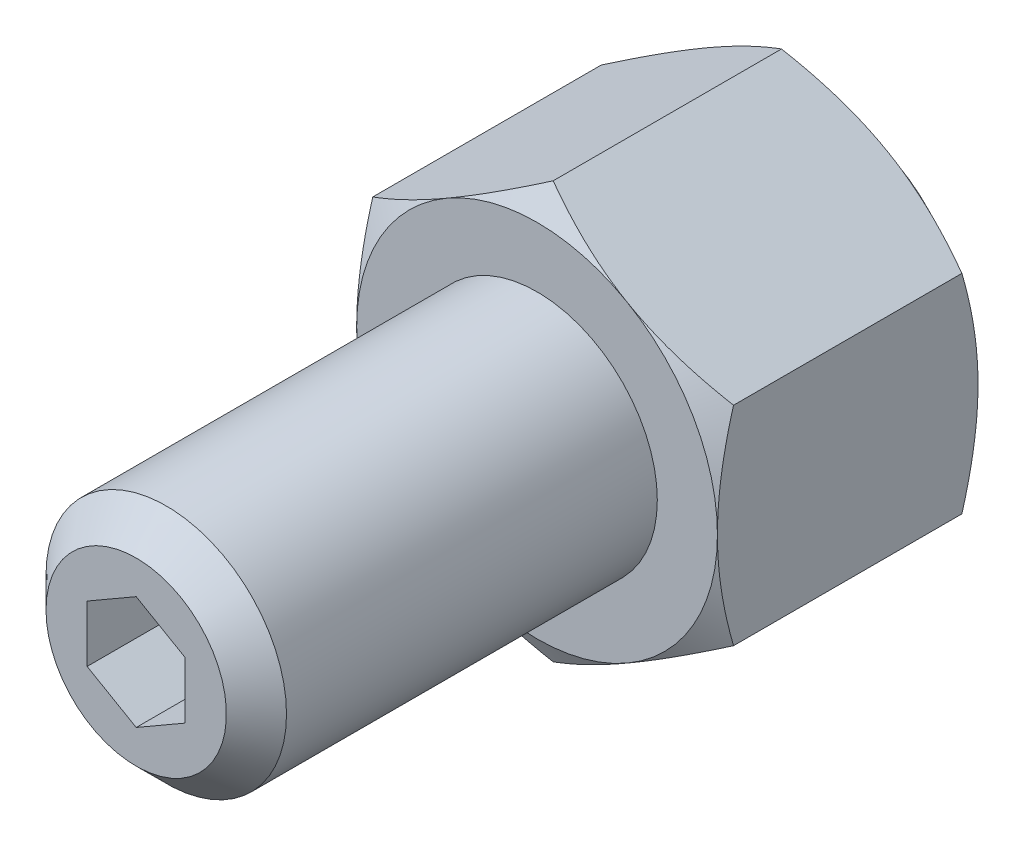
ISO-10303-21;
HEADER;
FILE_DESCRIPTION(('STEP AP214'),'2;1');
FILE_NAME('part.step','',(''),(''),'','','');
FILE_SCHEMA(('AUTOMOTIVE_DESIGN { 1 0 10303 214 1 1 1 1 }'));
ENDSEC;
DATA;
#1=APPLICATION_CONTEXT('core data for automotive mechanical design processes');
#2=APPLICATION_PROTOCOL_DEFINITION('international standard','automotive_design',2000,#1);
#3=PRODUCT_CONTEXT('',#1,'mechanical');
#4=PRODUCT('Part','Part','',(#3));
#5=PRODUCT_RELATED_PRODUCT_CATEGORY('part','',(#4));
#6=PRODUCT_DEFINITION_FORMATION('','',#4);
#7=PRODUCT_DEFINITION_CONTEXT('part definition',#1,'design');
#8=PRODUCT_DEFINITION('design','',#6,#7);
#9=PRODUCT_DEFINITION_SHAPE('','',#8);
#10=(LENGTH_UNIT() NAMED_UNIT(*) SI_UNIT(.MILLI.,.METRE.));
#11=(NAMED_UNIT(*) PLANE_ANGLE_UNIT() SI_UNIT($,.RADIAN.));
#12=(NAMED_UNIT(*) SI_UNIT($,.STERADIAN.) SOLID_ANGLE_UNIT());
#13=UNCERTAINTY_MEASURE_WITH_UNIT(LENGTH_MEASURE(1.E-05),#10,'distance_accuracy_value','');
#14=(GEOMETRIC_REPRESENTATION_CONTEXT(3) GLOBAL_UNCERTAINTY_ASSIGNED_CONTEXT((#13)) GLOBAL_UNIT_ASSIGNED_CONTEXT((#10,
#11,#12)) REPRESENTATION_CONTEXT('',''));
#15=CARTESIAN_POINT('',(0.,0.,0.));
#16=DIRECTION('',(0.,0.,1.));
#17=DIRECTION('',(1.,0.,0.));
#18=AXIS2_PLACEMENT_3D('',#15,#16,#17);
#19=CARTESIAN_POINT('',(1.00613961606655E-13,-20.7846096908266,100.));
#20=DIRECTION('',(-0.5,-0.866025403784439,0.));
#21=DIRECTION('',(-0.866025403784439,0.5,0.));
#22=AXIS2_PLACEMENT_3D('',#19,#20,#21);
#23=PLANE('',#22);
#24=DIRECTION('',(0.,0.,-1.));
#25=VECTOR('',#24,1.);
#26=CARTESIAN_POINT('',(-18.,-10.3923048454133,100.));
#27=LINE('',#26,#25);
#28=CARTESIAN_POINT('',(-18.,-10.3923048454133,28.3923048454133));
#29=VERTEX_POINT('',#28);
#30=CARTESIAN_POINT('',(-18.,-10.3923048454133,5.60769515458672));
#31=VERTEX_POINT('',#30);
#32=EDGE_CURVE('E170',#29,#31,#27,.T.);
#33=ORIENTED_EDGE('',*,*,#32,.T.);
#34=CARTESIAN_POINT('',(-18.0002,-10.3921893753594,5.60776182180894));
#35=CARTESIAN_POINT('',(-17.6045674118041,-10.6206079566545,5.47589336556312));
#36=CARTESIAN_POINT('',(-17.2073916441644,-10.8499174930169,5.35000889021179));
#37=CARTESIAN_POINT('',(-16.4098552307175,-11.310375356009,5.11187123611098));
#38=CARTESIAN_POINT('',(-16.0094935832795,-11.5415242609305,4.99962254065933));
#39=CARTESIAN_POINT('',(-15.2048116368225,-12.0061075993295,4.79026529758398));
#40=CARTESIAN_POINT('',(-14.8004842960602,-12.2395460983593,4.69319257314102));
#41=CARTESIAN_POINT('',(-13.9890201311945,-12.7080451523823,4.51627174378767));
#42=CARTESIAN_POINT('',(-13.5818834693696,-12.9431056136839,4.43642265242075));
#43=CARTESIAN_POINT('',(-12.7752328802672,-13.4088255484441,4.29734530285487));
#44=CARTESIAN_POINT('',(-12.3757788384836,-13.6394504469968,4.23765672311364));
#45=CARTESIAN_POINT('',(-11.5750403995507,-14.1017570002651,4.13757237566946));
#46=CARTESIAN_POINT('',(-11.1737559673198,-14.3334386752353,4.09717697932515));
#47=CARTESIAN_POINT('',(-10.370513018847,-14.7971912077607,4.03669895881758));
#48=CARTESIAN_POINT('',(-9.96855587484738,-15.0292612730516,4.01659219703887));
#49=CARTESIAN_POINT('',(-9.16427056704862,-15.4936156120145,3.99712385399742));
#50=CARTESIAN_POINT('',(-8.76194241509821,-15.7258998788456,3.99776163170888));
#51=CARTESIAN_POINT('',(-8.00978065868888,-16.1601606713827,4.01833357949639));
#52=CARTESIAN_POINT('',(-7.65989346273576,-16.3621681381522,4.03575918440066));
#53=CARTESIAN_POINT('',(-6.96095368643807,-16.765701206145,4.08596906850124));
#54=CARTESIAN_POINT('',(-6.6119010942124,-16.9672268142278,4.11875312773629));
#55=CARTESIAN_POINT('',(-5.91476277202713,-17.3697198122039,4.1991110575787));
#56=CARTESIAN_POINT('',(-5.56667820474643,-17.5706865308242,4.24669830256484));
#57=CARTESIAN_POINT('',(-4.87216610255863,-17.9716632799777,4.35582287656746));
#58=CARTESIAN_POINT('',(-4.52573856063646,-18.1716733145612,4.41736014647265));
#59=CARTESIAN_POINT('',(-3.47411308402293,-18.7788295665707,4.62446207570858));
#60=CARTESIAN_POINT('',(-2.77196054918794,-19.1842175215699,4.79067746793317));
#61=CARTESIAN_POINT('',(-1.37812528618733,-19.9889486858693,5.16791817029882));
#62=CARTESIAN_POINT('',(-0.68642471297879,-20.3883021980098,5.37885488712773));
#63=CARTESIAN_POINT('',(0.00020000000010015,-20.7847251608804,5.60776182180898));
#64=B_SPLINE_CURVE_WITH_KNOTS('',3,(#34,#35,#36,#37,#38,#39,#40,#41,#42,#43,#44,#45,#46,#47,#48,
#49,#50,#51,#52,#53,#54,#55,#56,#57,#58,#59,#60,#61,#62,#63),.UNSPECIFIED.,.F.,.F.,(4,2,2,2,2,2,
2,2,2,2,2,2,2,2,4),(0.,1.42650335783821,2.85347447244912,4.28376471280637,5.71397301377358,
7.10888071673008,8.50381526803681,9.8970882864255,11.2903182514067,12.5031974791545,
13.7160593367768,14.9300201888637,16.1439758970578,18.6253607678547,21.1018751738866),.UNSPECIFIED.);
#65=CARTESIAN_POINT('',(-9.,-15.5884572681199,4.));
#66=VERTEX_POINT('',#65);
#67=EDGE_CURVE('E149',#31,#66,#64,.T.);
#68=ORIENTED_EDGE('',*,*,#67,.T.);
#69=CARTESIAN_POINT('',(1.00406959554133E-13,-20.7846096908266,5.60769515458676));
#70=VERTEX_POINT('',#69);
#71=EDGE_CURVE('E160',#66,#70,#64,.T.);
#72=ORIENTED_EDGE('',*,*,#71,.T.);
#73=DIRECTION('',(0.,0.,-1.));
#74=VECTOR('',#73,1.);
#75=CARTESIAN_POINT('',(1.00613961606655E-13,-20.7846096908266,100.));
#76=LINE('',#75,#74);
#77=CARTESIAN_POINT('',(1.00589838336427E-13,-20.7846096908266,28.3923048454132));
#78=VERTEX_POINT('',#77);
#79=EDGE_CURVE('E349',#78,#70,#76,.T.);
#80=ORIENTED_EDGE('',*,*,#79,.F.);
#81=CARTESIAN_POINT('',(0.000200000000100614,-20.7847251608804,28.3922381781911));
#82=CARTESIAN_POINT('',(-0.395432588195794,-20.5563065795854,28.5241066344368));
#83=CARTESIAN_POINT('',(-0.792608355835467,-20.326997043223,28.6499911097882));
#84=CARTESIAN_POINT('',(-1.59014476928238,-19.8665391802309,28.888128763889));
#85=CARTESIAN_POINT('',(-1.99050641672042,-19.6353902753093,29.0003774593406));
#86=CARTESIAN_POINT('',(-2.79518836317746,-19.1708069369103,29.209734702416));
#87=CARTESIAN_POINT('',(-3.1995157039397,-18.9373684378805,29.306807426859));
#88=CARTESIAN_POINT('',(-4.01097986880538,-18.4688693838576,29.4837282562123));
#89=CARTESIAN_POINT('',(-4.41811653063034,-18.233808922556,29.5635773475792));
#90=CARTESIAN_POINT('',(-5.22476711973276,-17.7680889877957,29.7026546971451));
#91=CARTESIAN_POINT('',(-5.62422116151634,-17.5374640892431,29.7623432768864));
#92=CARTESIAN_POINT('',(-6.42495960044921,-17.0751575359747,29.8624276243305));
#93=CARTESIAN_POINT('',(-6.82624403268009,-16.8434758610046,29.9028230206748));
#94=CARTESIAN_POINT('',(-7.62948698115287,-16.3797233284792,29.9633010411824));
#95=CARTESIAN_POINT('',(-8.03144412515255,-16.1476532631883,29.9834078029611));
#96=CARTESIAN_POINT('',(-8.8357294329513,-15.6832989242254,30.0028761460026));
#97=CARTESIAN_POINT('',(-9.23805758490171,-15.4510146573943,30.0022383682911));
#98=CARTESIAN_POINT('',(-9.99021934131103,-15.0167538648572,29.9816664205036));
#99=CARTESIAN_POINT('',(-10.3401065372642,-14.8147463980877,29.9642408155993));
#100=CARTESIAN_POINT('',(-11.0390463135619,-14.4112133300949,29.9140309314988));
#101=CARTESIAN_POINT('',(-11.3880989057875,-14.209687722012,29.8812468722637));
#102=CARTESIAN_POINT('',(-12.0852372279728,-13.807194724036,29.8008889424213));
#103=CARTESIAN_POINT('',(-12.4333217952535,-13.6062280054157,29.7533016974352));
#104=CARTESIAN_POINT('',(-13.1278338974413,-13.2052512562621,29.6441771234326));
#105=CARTESIAN_POINT('',(-13.4742614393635,-13.0052412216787,29.5826398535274));
#106=CARTESIAN_POINT('',(-14.525886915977,-12.3980849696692,29.3755379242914));
#107=CARTESIAN_POINT('',(-15.228039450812,-11.99269701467,29.2093225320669));
#108=CARTESIAN_POINT('',(-16.6218747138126,-11.1879658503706,28.8320818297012));
#109=CARTESIAN_POINT('',(-17.3135752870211,-10.7886123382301,28.6211451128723));
#110=CARTESIAN_POINT('',(-18.0002,-10.3921893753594,28.3922381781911));
#111=B_SPLINE_CURVE_WITH_KNOTS('',3,(#81,#82,#83,#84,#85,#86,#87,#88,#89,#90,#91,#92,#93,#94,
#95,#96,#97,#98,#99,#100,#101,#102,#103,#104,#105,#106,#107,#108,#109,#110),.UNSPECIFIED.,.F.,
.F.,(4,2,2,2,2,2,2,2,2,2,2,2,2,2,4),(0.,1.42650335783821,2.85347447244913,4.28376471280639,
5.7139730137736,7.1088807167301,8.50381526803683,9.89708828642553,11.2903182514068,
12.5031974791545,13.7160593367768,14.9300201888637,16.1439758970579,18.6253607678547,
21.1018751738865),.UNSPECIFIED.);
#112=CARTESIAN_POINT('',(-9.,-15.5884572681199,30.));
#113=VERTEX_POINT('',#112);
#114=EDGE_CURVE('E347',#78,#113,#111,.T.);
#115=ORIENTED_EDGE('',*,*,#114,.T.);
#116=EDGE_CURVE('E235',#113,#29,#111,.T.);
#117=ORIENTED_EDGE('',*,*,#116,.T.);
#118=EDGE_LOOP('',(#33,#68,#72,#80,#115,#117));
#119=FACE_BOUND('',#118,.T.);
#120=ADVANCED_FACE('F14',(#119),#23,.T.);
#121=CARTESIAN_POINT('',(-18.,-10.3923048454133,100.));
#122=DIRECTION('',(-1.,0.,0.));
#123=DIRECTION('',(0.,1.,0.));
#124=AXIS2_PLACEMENT_3D('',#121,#122,#123);
#125=PLANE('',#124);
#126=DIRECTION('',(0.,0.,-1.));
#127=VECTOR('',#126,1.);
#128=CARTESIAN_POINT('',(-18.,10.3923048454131,100.));
#129=LINE('',#128,#127);
#130=CARTESIAN_POINT('',(-18.,10.3923048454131,28.3923048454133));
#131=VERTEX_POINT('',#130);
#132=CARTESIAN_POINT('',(-18.,10.3923048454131,5.60769515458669));
#133=VERTEX_POINT('',#132);
#134=EDGE_CURVE('E306',#131,#133,#129,.T.);
#135=ORIENTED_EDGE('',*,*,#134,.T.);
#136=CARTESIAN_POINT('',(-18.,-27.86360890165,12.7595506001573));
#137=CARTESIAN_POINT('',(-18.,-27.4707558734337,12.5690366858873));
#138=CARTESIAN_POINT('',(-18.,-27.0774404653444,12.3794766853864));
#139=CARTESIAN_POINT('',(-18.,-26.2897883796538,12.0024806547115));
#140=CARTESIAN_POINT('',(-18.,-25.8954516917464,11.815044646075));
#141=CARTESIAN_POINT('',(-18.,-24.710659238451,11.2561970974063));
#142=CARTESIAN_POINT('',(-18.,-23.9185380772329,10.8883029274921));
#143=CARTESIAN_POINT('',(-18.,-22.3246422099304,10.1621368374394));
#144=CARTESIAN_POINT('',(-18.,-21.5228383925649,9.80392866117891));
#145=CARTESIAN_POINT('',(-18.,-19.9128364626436,9.10223396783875));
#146=CARTESIAN_POINT('',(-18.,-19.1046386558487,8.75874675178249));
#147=CARTESIAN_POINT('',(-18.,-17.4546447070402,8.07972494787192));
#148=CARTESIAN_POINT('',(-18.,-16.6125990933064,7.74479339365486));
#149=CARTESIAN_POINT('',(-18.,-14.9186314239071,7.10040266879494));
#150=CARTESIAN_POINT('',(-18.,-14.0667082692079,6.79094636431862));
#151=CARTESIAN_POINT('',(-18.,-12.353269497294,6.20567241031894));
#152=CARTESIAN_POINT('',(-18.,-11.491777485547,5.92978621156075));
#153=CARTESIAN_POINT('',(-18.,-9.75635395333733,5.4205240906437));
#154=CARTESIAN_POINT('',(-18.,-8.88242646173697,5.18713472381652));
#155=CARTESIAN_POINT('',(-18.,-7.56448210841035,4.87803315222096));
#156=CARTESIAN_POINT('',(-18.,-7.12519367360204,4.78203525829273));
#157=CARTESIAN_POINT('',(-18.,-6.24362484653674,4.60484807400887));
#158=CARTESIAN_POINT('',(-18.,-5.80134451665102,4.5236584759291));
#159=CARTESIAN_POINT('',(-18.,-4.91410844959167,4.3775254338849));
#160=CARTESIAN_POINT('',(-18.,-4.46915279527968,4.31258148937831));
#161=CARTESIAN_POINT('',(-18.,-3.57701724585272,4.20023317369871));
#162=CARTESIAN_POINT('',(-18.,-3.1298373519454,4.15282879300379));
#163=CARTESIAN_POINT('',(-18.,-2.23971857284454,4.07709693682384));
#164=CARTESIAN_POINT('',(-18.,-1.79680025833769,4.04852915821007));
#165=CARTESIAN_POINT('',(-18.,-0.910153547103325,4.01014623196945));
#166=CARTESIAN_POINT('',(-18.,-0.466425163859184,4.00033077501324));
#167=CARTESIAN_POINT('',(-18.,0.421050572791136,3.99968573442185));
#168=CARTESIAN_POINT('',(-18.,0.864797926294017,4.00885626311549));
#169=CARTESIAN_POINT('',(-18.,1.75151207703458,4.04596044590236));
#170=CARTESIAN_POINT('',(-18.,2.19447883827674,4.07389494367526));
#171=CARTESIAN_POINT('',(-18.,3.26064774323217,4.16312152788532));
#172=CARTESIAN_POINT('',(-18.,3.88311057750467,4.23340427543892));
#173=CARTESIAN_POINT('',(-18.,5.12338610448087,4.40718134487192));
#174=CARTESIAN_POINT('',(-18.,5.74119814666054,4.5106802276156));
#175=CARTESIAN_POINT('',(-18.,6.97159429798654,4.74720760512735));
#176=CARTESIAN_POINT('',(-18.,7.58417389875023,4.88025932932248));
#177=CARTESIAN_POINT('',(-18.,8.80317308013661,5.17183492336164));
#178=CARTESIAN_POINT('',(-18.,9.4095927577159,5.33035839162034));
#179=CARTESIAN_POINT('',(-18.,10.6295342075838,5.67274914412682));
#180=CARTESIAN_POINT('',(-18.,11.2429205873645,5.85709550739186));
#181=CARTESIAN_POINT('',(-18.,12.463650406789,6.24471350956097));
#182=CARTESIAN_POINT('',(-18.,13.0709938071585,6.44798527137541));
#183=CARTESIAN_POINT('',(-18.,14.2799395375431,6.87023728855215));
#184=CARTESIAN_POINT('',(-18.,14.8815437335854,7.08921222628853));
#185=CARTESIAN_POINT('',(-18.,16.0797756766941,7.54030643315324));
#186=CARTESIAN_POINT('',(-18.,16.6764034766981,7.77242556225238));
#187=CARTESIAN_POINT('',(-18.,18.0620442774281,8.32628972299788));
#188=CARTESIAN_POINT('',(-18.,18.8493626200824,8.65226750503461));
#189=CARTESIAN_POINT('',(-18.,20.4174707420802,9.3196083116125));
#190=CARTESIAN_POINT('',(-18.,21.1982601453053,9.66097221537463));
#191=CARTESIAN_POINT('',(-18.,22.7544953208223,10.3560680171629));
#192=CARTESIAN_POINT('',(-18.,23.5299399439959,10.709802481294));
#193=CARTESIAN_POINT('',(-18.,25.0761947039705,11.4271968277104));
#194=CARTESIAN_POINT('',(-18.,25.8470049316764,11.7908565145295));
#195=CARTESIAN_POINT('',(-18.,27.3855435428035,12.5266640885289));
#196=CARTESIAN_POINT('',(-18.,28.1532678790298,12.8988204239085));
#197=CARTESIAN_POINT('',(-18.,29.6854344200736,13.6498275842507));
#198=CARTESIAN_POINT('',(-18.,30.4498766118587,14.0286784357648));
#199=CARTESIAN_POINT('',(-18.,31.9758839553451,14.791902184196));
#200=CARTESIAN_POINT('',(-18.,32.7374494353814,15.1762744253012));
#201=CARTESIAN_POINT('',(-18.,34.2581982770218,15.9496947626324));
#202=CARTESIAN_POINT('',(-18.,35.0173816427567,16.3387428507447));
#203=CARTESIAN_POINT('',(-18.,37.1682815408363,17.4480530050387));
#204=CARTESIAN_POINT('',(-18.,38.5575846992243,18.172994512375));
#205=CARTESIAN_POINT('',(-18.,41.3309852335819,19.6328547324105));
#206=CARTESIAN_POINT('',(-18.,42.7150824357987,20.3677737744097));
#207=CARTESIAN_POINT('',(-18.,45.475874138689,21.8435097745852));
#208=CARTESIAN_POINT('',(-18.,46.8525784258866,22.5843084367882));
#209=CARTESIAN_POINT('',(-18.,48.9151675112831,23.6999760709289));
#210=CARTESIAN_POINT('',(-18.,49.6022682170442,24.0726005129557));
#211=CARTESIAN_POINT('',(-18.,50.9757388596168,24.8191913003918));
#212=CARTESIAN_POINT('',(-18.,51.662108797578,25.1931576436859));
#213=CARTESIAN_POINT('',(-18.,52.3481542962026,25.56771840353));
#214=B_SPLINE_CURVE_WITH_KNOTS('',3,(#136,#137,#138,#139,#140,#141,#142,#143,#144,#145,#146,
#147,#148,#149,#150,#151,#152,#153,#154,#155,#156,#157,#158,#159,#160,#161,#162,#163,#164,#165,
#166,#167,#168,#169,#170,#171,#172,#173,#174,#175,#176,#177,#178,#179,#180,#181,#182,#183,#184,
#185,#186,#187,#188,#189,#190,#191,#192,#193,#194,#195,#196,#197,#198,#199,#200,#201,#202,#203,
#204,#205,#206,#207,#208,#209,#210,#211,#212,#213),.UNSPECIFIED.,.F.,.F.,(4,2,2,2,2,2,2,2,2,2,2,
2,2,2,2,2,2,2,2,2,2,2,2,2,2,2,2,2,2,2,2,2,2,2,2,2,2,2,4),(0.,1.30983022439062,2.61967371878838,
5.23975096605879,7.87417970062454,10.5084832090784,13.2268041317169,15.9454304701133,
18.658408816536,21.3705273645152,22.7192841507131,24.0680129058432,25.4167001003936,
26.7653865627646,28.0965163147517,29.4276241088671,30.7587397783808,32.0899153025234,
33.9681291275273,35.8466009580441,37.7265545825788,39.6064785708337,41.5275809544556,
43.4486958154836,45.3691631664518,47.2896100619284,49.8457914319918,52.4021190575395,
54.9589801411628,57.5157909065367,60.0752653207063,62.6347498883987,65.1939329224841,
67.7531115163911,72.4542556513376,77.1555553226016,81.8456178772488,84.1905276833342,
86.5354337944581),.UNSPECIFIED.);
#215=CARTESIAN_POINT('',(-18.,0.,4.));
#216=VERTEX_POINT('',#215);
#217=EDGE_CURVE('E289',#133,#216,#214,.F.);
#218=ORIENTED_EDGE('',*,*,#217,.T.);
#219=EDGE_CURVE('E151',#216,#31,#214,.F.);
#220=ORIENTED_EDGE('',*,*,#219,.T.);
#221=ORIENTED_EDGE('',*,*,#32,.F.);
#222=CARTESIAN_POINT('',(-18.,-27.86360890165,21.2404493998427));
#223=CARTESIAN_POINT('',(-18.,-27.4707558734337,21.4309633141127));
#224=CARTESIAN_POINT('',(-18.,-27.0774404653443,21.6205233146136));
#225=CARTESIAN_POINT('',(-18.,-26.2897883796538,21.9975193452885));
#226=CARTESIAN_POINT('',(-18.,-25.8954516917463,22.1849553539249));
#227=CARTESIAN_POINT('',(-18.,-24.710659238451,22.7438029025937));
#228=CARTESIAN_POINT('',(-18.,-23.9185380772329,23.1116970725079));
#229=CARTESIAN_POINT('',(-18.,-22.3246422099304,23.8378631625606));
#230=CARTESIAN_POINT('',(-18.,-21.5228383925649,24.196071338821));
#231=CARTESIAN_POINT('',(-18.,-19.9128364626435,24.8977660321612));
#232=CARTESIAN_POINT('',(-18.,-19.1046386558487,25.2412532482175));
#233=CARTESIAN_POINT('',(-18.,-17.4546447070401,25.9202750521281));
#234=CARTESIAN_POINT('',(-18.,-16.6125990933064,26.2552066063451));
#235=CARTESIAN_POINT('',(-18.,-14.9186314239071,26.899597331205));
#236=CARTESIAN_POINT('',(-18.,-14.0667082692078,27.2090536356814));
#237=CARTESIAN_POINT('',(-18.,-12.353269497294,27.794327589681));
#238=CARTESIAN_POINT('',(-18.,-11.491777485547,28.0702137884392));
#239=CARTESIAN_POINT('',(-18.,-9.75635395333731,28.5794759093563));
#240=CARTESIAN_POINT('',(-18.,-8.88242646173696,28.8128652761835));
#241=CARTESIAN_POINT('',(-18.,-7.56448210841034,29.1219668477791));
#242=CARTESIAN_POINT('',(-18.,-7.12519367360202,29.2179647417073));
#243=CARTESIAN_POINT('',(-18.,-6.24362484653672,29.3951519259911));
#244=CARTESIAN_POINT('',(-18.,-5.80134451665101,29.4763415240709));
#245=CARTESIAN_POINT('',(-18.,-4.91410844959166,29.6224745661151));
#246=CARTESIAN_POINT('',(-18.,-4.46915279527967,29.6874185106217));
#247=CARTESIAN_POINT('',(-18.,-3.57701724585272,29.7997668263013));
#248=CARTESIAN_POINT('',(-18.,-3.12983735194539,29.8471712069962));
#249=CARTESIAN_POINT('',(-18.,-2.23971857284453,29.9229030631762));
#250=CARTESIAN_POINT('',(-18.,-1.79680025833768,29.9514708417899));
#251=CARTESIAN_POINT('',(-18.,-0.910153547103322,29.9898537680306));
#252=CARTESIAN_POINT('',(-18.,-0.466425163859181,29.9996692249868));
#253=CARTESIAN_POINT('',(-18.,0.421050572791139,30.0003142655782));
#254=CARTESIAN_POINT('',(-18.,0.864797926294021,29.9911437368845));
#255=CARTESIAN_POINT('',(-18.,1.75151207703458,29.9540395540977));
#256=CARTESIAN_POINT('',(-18.,2.19447883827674,29.9261050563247));
#257=CARTESIAN_POINT('',(-18.,3.26064774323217,29.8368784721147));
#258=CARTESIAN_POINT('',(-18.,3.88311057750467,29.7665957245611));
#259=CARTESIAN_POINT('',(-18.,5.12338610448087,29.5928186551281));
#260=CARTESIAN_POINT('',(-18.,5.74119814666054,29.4893197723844));
#261=CARTESIAN_POINT('',(-18.,6.97159429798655,29.2527923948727));
#262=CARTESIAN_POINT('',(-18.,7.58417389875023,29.1197406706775));
#263=CARTESIAN_POINT('',(-18.,8.80317308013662,28.8281650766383));
#264=CARTESIAN_POINT('',(-18.,9.4095927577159,28.6696416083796));
#265=CARTESIAN_POINT('',(-18.,10.6295342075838,28.3272508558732));
#266=CARTESIAN_POINT('',(-18.,11.2429205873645,28.1429044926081));
#267=CARTESIAN_POINT('',(-18.,12.463650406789,27.755286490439));
#268=CARTESIAN_POINT('',(-18.,13.0709938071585,27.5520147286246));
#269=CARTESIAN_POINT('',(-18.,14.2799395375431,27.1297627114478));
#270=CARTESIAN_POINT('',(-18.,14.8815437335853,26.9107877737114));
#271=CARTESIAN_POINT('',(-18.,16.0797756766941,26.4596935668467));
#272=CARTESIAN_POINT('',(-18.,16.6764034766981,26.2275744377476));
#273=CARTESIAN_POINT('',(-18.,18.0620442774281,25.6737102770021));
#274=CARTESIAN_POINT('',(-18.,18.8493626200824,25.3477324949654));
#275=CARTESIAN_POINT('',(-18.,20.4174707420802,24.6803916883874));
#276=CARTESIAN_POINT('',(-18.,21.1982601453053,24.3390277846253));
#277=CARTESIAN_POINT('',(-18.,22.7544953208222,23.643931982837));
#278=CARTESIAN_POINT('',(-18.,23.5299399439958,23.2901975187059));
#279=CARTESIAN_POINT('',(-18.,25.0761947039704,22.5728031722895));
#280=CARTESIAN_POINT('',(-18.,25.8470049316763,22.2091434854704));
#281=CARTESIAN_POINT('',(-18.,27.3855435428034,21.473335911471));
#282=CARTESIAN_POINT('',(-18.,28.1532678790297,21.1011795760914));
#283=CARTESIAN_POINT('',(-18.,29.6854344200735,20.3501724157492));
#284=CARTESIAN_POINT('',(-18.,30.4498766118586,19.9713215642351));
#285=CARTESIAN_POINT('',(-18.,31.975883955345,19.2080978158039));
#286=CARTESIAN_POINT('',(-18.,32.7374494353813,18.8237255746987));
#287=CARTESIAN_POINT('',(-18.,34.2581982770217,18.0503052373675));
#288=CARTESIAN_POINT('',(-18.,35.0173816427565,17.6612571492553));
#289=CARTESIAN_POINT('',(-18.,37.1682815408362,16.5519469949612));
#290=CARTESIAN_POINT('',(-18.,38.5575846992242,15.8270054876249));
#291=CARTESIAN_POINT('',(-18.,41.3309852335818,14.3671452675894));
#292=CARTESIAN_POINT('',(-18.,42.7150824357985,13.6322262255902));
#293=CARTESIAN_POINT('',(-18.,45.4758741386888,12.1564902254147));
#294=CARTESIAN_POINT('',(-18.,46.8525784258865,11.4156915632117));
#295=CARTESIAN_POINT('',(-18.,48.9151675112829,10.300023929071));
#296=CARTESIAN_POINT('',(-18.,49.602268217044,9.92739948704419));
#297=CARTESIAN_POINT('',(-18.,50.9757388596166,9.18080869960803));
#298=CARTESIAN_POINT('',(-18.,51.6621087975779,8.80684235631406));
#299=CARTESIAN_POINT('',(-18.,52.3481542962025,8.43228159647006));
#300=B_SPLINE_CURVE_WITH_KNOTS('',3,(#222,#223,#224,#225,#226,#227,#228,#229,#230,#231,#232,
#233,#234,#235,#236,#237,#238,#239,#240,#241,#242,#243,#244,#245,#246,#247,#248,#249,#250,#251,
#252,#253,#254,#255,#256,#257,#258,#259,#260,#261,#262,#263,#264,#265,#266,#267,#268,#269,#270,
#271,#272,#273,#274,#275,#276,#277,#278,#279,#280,#281,#282,#283,#284,#285,#286,#287,#288,#289,
#290,#291,#292,#293,#294,#295,#296,#297,#298,#299),.UNSPECIFIED.,.F.,.F.,(4,2,2,2,2,2,2,2,2,2,2,
2,2,2,2,2,2,2,2,2,2,2,2,2,2,2,2,2,2,2,2,2,2,2,2,2,2,2,4),(0.,1.30983022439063,2.61967371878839,
5.2397509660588,7.87417970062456,10.5084832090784,13.2268041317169,15.9454304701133,
18.658408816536,21.3705273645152,22.7192841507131,24.0680129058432,25.4167001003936,
26.7653865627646,28.0965163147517,29.4276241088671,30.7587397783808,32.0899153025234,
33.9681291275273,35.8466009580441,37.7265545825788,39.6064785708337,41.5275809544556,
43.4486958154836,45.3691631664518,47.2896100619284,49.8457914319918,52.4021190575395,
54.9589801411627,57.5157909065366,60.0752653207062,62.6347498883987,65.193932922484,
67.7531115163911,72.4542556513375,77.1555553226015,81.8456178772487,84.1905276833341,
86.535433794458),.UNSPECIFIED.);
#301=CARTESIAN_POINT('',(-18.,0.,30.));
#302=VERTEX_POINT('',#301);
#303=EDGE_CURVE('E245',#29,#302,#300,.T.);
#304=ORIENTED_EDGE('',*,*,#303,.T.);
#305=EDGE_CURVE('E265',#302,#131,#300,.T.);
#306=ORIENTED_EDGE('',*,*,#305,.T.);
#307=EDGE_LOOP('',(#135,#218,#220,#221,#304,#306));
#308=FACE_BOUND('',#307,.T.);
#309=ADVANCED_FACE('F269',(#308),#125,.T.);
#310=CARTESIAN_POINT('',(-1.07552855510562E-13,20.7846096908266,100.));
#311=DIRECTION('',(0.500000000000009,-0.866025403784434,0.));
#312=DIRECTION('',(-0.866025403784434,-0.500000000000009,0.));
#313=AXIS2_PLACEMENT_3D('',#310,#311,#312);
#314=PLANE('',#313);
#315=CARTESIAN_POINT('',(-18.0002,10.3921893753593,5.6077618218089));
#316=CARTESIAN_POINT('',(-17.6045674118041,10.6206079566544,5.47589336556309));
#317=CARTESIAN_POINT('',(-17.2073916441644,10.8499174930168,5.35000889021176));
#318=CARTESIAN_POINT('',(-16.4098552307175,11.3103753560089,5.11187123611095));
#319=CARTESIAN_POINT('',(-16.0094935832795,11.5415242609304,4.99962254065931));
#320=CARTESIAN_POINT('',(-15.2048116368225,12.0061075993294,4.79026529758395));
#321=CARTESIAN_POINT('',(-14.8004842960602,12.2395460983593,4.69319257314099));
#322=CARTESIAN_POINT('',(-13.9890201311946,12.7080451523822,4.51627174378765));
#323=CARTESIAN_POINT('',(-13.5818834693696,12.9431056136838,4.43642265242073));
#324=CARTESIAN_POINT('',(-12.7752328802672,13.4088255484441,4.29734530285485));
#325=CARTESIAN_POINT('',(-12.3757788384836,13.6394504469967,4.23765672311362));
#326=CARTESIAN_POINT('',(-11.5750403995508,14.1017570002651,4.13757237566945));
#327=CARTESIAN_POINT('',(-11.1737559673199,14.3334386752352,4.09717697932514));
#328=CARTESIAN_POINT('',(-10.3705130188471,14.7971912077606,4.03669895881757));
#329=CARTESIAN_POINT('',(-9.96855587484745,15.0292612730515,4.01659219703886));
#330=CARTESIAN_POINT('',(-9.1642705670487,15.4936156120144,3.99712385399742));
#331=CARTESIAN_POINT('',(-8.76194241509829,15.7258998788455,3.99776163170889));
#332=CARTESIAN_POINT('',(-8.00978065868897,16.1601606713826,4.0183335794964));
#333=CARTESIAN_POINT('',(-7.65989346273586,16.3621681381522,4.03575918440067));
#334=CARTESIAN_POINT('',(-6.96095368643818,16.765701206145,4.08596906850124));
#335=CARTESIAN_POINT('',(-6.61190109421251,16.9672268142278,4.11875312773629));
#336=CARTESIAN_POINT('',(-5.91476277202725,17.3697198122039,4.19911105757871));
#337=CARTESIAN_POINT('',(-5.56667820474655,17.5706865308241,4.24669830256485));
#338=CARTESIAN_POINT('',(-4.87216610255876,17.9716632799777,4.35582287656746));
#339=CARTESIAN_POINT('',(-4.5257385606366,18.1716733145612,4.41736014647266));
#340=CARTESIAN_POINT('',(-3.47411308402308,18.7788295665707,4.62446207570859));
#341=CARTESIAN_POINT('',(-2.77196054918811,19.1842175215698,4.79067746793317));
#342=CARTESIAN_POINT('',(-1.37812528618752,19.9889486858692,5.16791817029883));
#343=CARTESIAN_POINT('',(-0.686424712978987,20.3883021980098,5.37885488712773));
#344=CARTESIAN_POINT('',(0.000199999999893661,20.7847251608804,5.60776182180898));
#345=B_SPLINE_CURVE_WITH_KNOTS('',3,(#315,#316,#317,#318,#319,#320,#321,#322,#323,#324,#325,
#326,#327,#328,#329,#330,#331,#332,#333,#334,#335,#336,#337,#338,#339,#340,#341,#342,#343,#344),
.UNSPECIFIED.,.F.,.F.,(4,2,2,2,2,2,2,2,2,2,2,2,2,2,4),(0.,1.42650335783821,2.85347447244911,
4.28376471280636,5.71397301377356,7.10888071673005,8.50381526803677,9.89708828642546,
11.2903182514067,12.5031974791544,13.7160593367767,14.9300201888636,16.1439758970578,
18.6253607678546,21.1018751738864),.UNSPECIFIED.);
#346=CARTESIAN_POINT('',(-9.00000000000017,15.5884572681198,4.));
#347=VERTEX_POINT('',#346);
#348=EDGE_CURVE('E280',#133,#347,#345,.T.);
#349=ORIENTED_EDGE('',*,*,#348,.F.);
#350=ORIENTED_EDGE('',*,*,#134,.F.);
#351=CARTESIAN_POINT('',(0.000199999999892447,20.7847251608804,28.3922381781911));
#352=CARTESIAN_POINT('',(-0.395432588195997,20.5563065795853,28.5241066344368));
#353=CARTESIAN_POINT('',(-0.792608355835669,20.326997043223,28.6499911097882));
#354=CARTESIAN_POINT('',(-1.59014476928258,19.8665391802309,28.888128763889));
#355=CARTESIAN_POINT('',(-1.99050641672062,19.6353902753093,29.0003774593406));
#356=CARTESIAN_POINT('',(-2.79518836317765,19.1708069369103,29.209734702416));
#357=CARTESIAN_POINT('',(-3.19951570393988,18.9373684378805,29.306807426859));
#358=CARTESIAN_POINT('',(-4.01097986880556,18.4688693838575,29.4837282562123));
#359=CARTESIAN_POINT('',(-4.41811653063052,18.2338089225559,29.5635773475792));
#360=CARTESIAN_POINT('',(-5.22476711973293,17.7680889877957,29.7026546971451));
#361=CARTESIAN_POINT('',(-5.62422116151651,17.537464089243,29.7623432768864));
#362=CARTESIAN_POINT('',(-6.42495960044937,17.0751575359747,29.8624276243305));
#363=CARTESIAN_POINT('',(-6.82624403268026,16.8434758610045,29.9028230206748));
#364=CARTESIAN_POINT('',(-7.62948698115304,16.3797233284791,29.9633010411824));
#365=CARTESIAN_POINT('',(-8.03144412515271,16.1476532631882,29.9834078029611));
#366=CARTESIAN_POINT('',(-8.83572943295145,15.6832989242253,30.0028761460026));
#367=CARTESIAN_POINT('',(-9.23805758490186,15.4510146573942,30.0022383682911));
#368=CARTESIAN_POINT('',(-9.99021934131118,15.0167538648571,29.9816664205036));
#369=CARTESIAN_POINT('',(-10.3401065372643,14.8147463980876,29.9642408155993));
#370=CARTESIAN_POINT('',(-11.039046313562,14.4112133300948,29.9140309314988));
#371=CARTESIAN_POINT('',(-11.3880989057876,14.2096877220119,29.8812468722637));
#372=CARTESIAN_POINT('',(-12.0852372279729,13.8071947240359,29.8008889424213));
#373=CARTESIAN_POINT('',(-12.4333217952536,13.6062280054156,29.7533016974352));
#374=CARTESIAN_POINT('',(-13.1278338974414,13.205251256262,29.6441771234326));
#375=CARTESIAN_POINT('',(-13.4742614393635,13.0052412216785,29.5826398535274));
#376=CARTESIAN_POINT('',(-14.525886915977,12.3980849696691,29.3755379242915));
#377=CARTESIAN_POINT('',(-15.228039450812,11.9926970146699,29.2093225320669));
#378=CARTESIAN_POINT('',(-16.6218747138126,11.1879658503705,28.8320818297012));
#379=CARTESIAN_POINT('',(-17.3135752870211,10.7886123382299,28.6211451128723));
#380=CARTESIAN_POINT('',(-18.0002,10.3921893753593,28.3922381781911));
#381=B_SPLINE_CURVE_WITH_KNOTS('',3,(#351,#352,#353,#354,#355,#356,#357,#358,#359,#360,#361,
#362,#363,#364,#365,#366,#367,#368,#369,#370,#371,#372,#373,#374,#375,#376,#377,#378,#379,#380),
.UNSPECIFIED.,.F.,.F.,(4,2,2,2,2,2,2,2,2,2,2,2,2,2,4),(0.,1.42650335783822,2.85347447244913,
4.28376471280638,5.71397301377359,7.1088807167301,8.50381526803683,9.89708828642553,
11.2903182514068,12.5031974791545,13.7160593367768,14.9300201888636,16.1439758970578,
18.6253607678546,21.1018751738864),.UNSPECIFIED.);
#382=CARTESIAN_POINT('',(-9.00000000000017,15.5884572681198,30.));
#383=VERTEX_POINT('',#382);
#384=EDGE_CURVE('E259',#383,#131,#381,.T.);
#385=ORIENTED_EDGE('',*,*,#384,.F.);
#386=CARTESIAN_POINT('',(-1.07576978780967E-13,20.7846096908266,28.3923048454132));
#387=VERTEX_POINT('',#386);
#388=EDGE_CURVE('E264',#387,#383,#381,.T.);
#389=ORIENTED_EDGE('',*,*,#388,.F.);
#390=DIRECTION('',(0.,0.,-1.));
#391=VECTOR('',#390,1.);
#392=CARTESIAN_POINT('',(-1.07552855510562E-13,20.7846096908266,100.));
#393=LINE('',#392,#391);
#394=CARTESIAN_POINT('',(-1.0779497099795E-13,20.7846096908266,5.60769515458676));
#395=VERTEX_POINT('',#394);
#396=EDGE_CURVE('E314',#387,#395,#393,.T.);
#397=ORIENTED_EDGE('',*,*,#396,.T.);
#398=EDGE_CURVE('E274',#347,#395,#345,.T.);
#399=ORIENTED_EDGE('',*,*,#398,.F.);
#400=EDGE_LOOP('',(#349,#350,#385,#389,#397,#399));
#401=FACE_BOUND('',#400,.T.);
#402=ADVANCED_FACE('F266',(#401),#314,.F.);
#403=CARTESIAN_POINT('',(-1.07552855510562E-13,20.7846096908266,100.));
#404=DIRECTION('',(0.5,0.866025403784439,0.));
#405=DIRECTION('',(0.866025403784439,-0.5,0.));
#406=AXIS2_PLACEMENT_3D('',#403,#404,#405);
#407=PLANE('',#406);
#408=DIRECTION('',(0.,0.,-1.));
#409=VECTOR('',#408,1.);
#410=CARTESIAN_POINT('',(18.,10.3923048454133,100.));
#411=LINE('',#410,#409);
#412=CARTESIAN_POINT('',(18.,10.3923048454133,28.3923048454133));
#413=VERTEX_POINT('',#412);
#414=CARTESIAN_POINT('',(18.,10.3923048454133,5.60769515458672));
#415=VERTEX_POINT('',#414);
#416=EDGE_CURVE('E326',#413,#415,#411,.T.);
#417=ORIENTED_EDGE('',*,*,#416,.T.);
#418=CARTESIAN_POINT('',(18.0002,10.3921893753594,5.60776182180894));
#419=CARTESIAN_POINT('',(17.6045674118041,10.6206079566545,5.47589336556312));
#420=CARTESIAN_POINT('',(17.2073916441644,10.8499174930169,5.35000889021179));
#421=CARTESIAN_POINT('',(16.4098552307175,11.310375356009,5.11187123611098));
#422=CARTESIAN_POINT('',(16.0094935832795,11.5415242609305,4.99962254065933));
#423=CARTESIAN_POINT('',(15.2048116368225,12.0061075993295,4.79026529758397));
#424=CARTESIAN_POINT('',(14.8004842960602,12.2395460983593,4.69319257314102));
#425=CARTESIAN_POINT('',(13.9890201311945,12.7080451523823,4.51627174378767));
#426=CARTESIAN_POINT('',(13.5818834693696,12.9431056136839,4.43642265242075));
#427=CARTESIAN_POINT('',(12.7752328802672,13.4088255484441,4.29734530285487));
#428=CARTESIAN_POINT('',(12.3757788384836,13.6394504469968,4.23765672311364));
#429=CARTESIAN_POINT('',(11.5750403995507,14.1017570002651,4.13757237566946));
#430=CARTESIAN_POINT('',(11.1737559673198,14.3334386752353,4.09717697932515));
#431=CARTESIAN_POINT('',(10.370513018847,14.7971912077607,4.03669895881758));
#432=CARTESIAN_POINT('',(9.96855587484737,15.0292612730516,4.01659219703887));
#433=CARTESIAN_POINT('',(9.16427056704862,15.4936156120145,3.99712385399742));
#434=CARTESIAN_POINT('',(8.76194241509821,15.7258998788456,3.99776163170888));
#435=CARTESIAN_POINT('',(8.00978065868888,16.1601606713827,4.01833357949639));
#436=CARTESIAN_POINT('',(7.65989346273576,16.3621681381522,4.03575918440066));
#437=CARTESIAN_POINT('',(6.96095368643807,16.765701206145,4.08596906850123));
#438=CARTESIAN_POINT('',(6.61190109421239,16.9672268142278,4.11875312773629));
#439=CARTESIAN_POINT('',(5.91476277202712,17.3697198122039,4.1991110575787));
#440=CARTESIAN_POINT('',(5.56667820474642,17.5706865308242,4.24669830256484));
#441=CARTESIAN_POINT('',(4.87216610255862,17.9716632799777,4.35582287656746));
#442=CARTESIAN_POINT('',(4.52573856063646,18.1716733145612,4.41736014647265));
#443=CARTESIAN_POINT('',(3.47411308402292,18.7788295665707,4.62446207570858));
#444=CARTESIAN_POINT('',(2.77196054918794,19.1842175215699,4.79067746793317));
#445=CARTESIAN_POINT('',(1.37812528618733,19.9889486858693,5.16791817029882));
#446=CARTESIAN_POINT('',(0.686424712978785,20.3883021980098,5.37885488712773));
#447=CARTESIAN_POINT('',(-0.000200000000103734,20.7847251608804,5.60776182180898));
#448=B_SPLINE_CURVE_WITH_KNOTS('',3,(#418,#419,#420,#421,#422,#423,#424,#425,#426,#427,#428,
#429,#430,#431,#432,#433,#434,#435,#436,#437,#438,#439,#440,#441,#442,#443,#444,#445,#446,#447),
.UNSPECIFIED.,.F.,.F.,(4,2,2,2,2,2,2,2,2,2,2,2,2,2,4),(0.,1.42650335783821,2.85347447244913,
4.28376471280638,5.71397301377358,7.10888071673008,8.50381526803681,9.8970882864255,
11.2903182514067,12.5031974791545,13.7160593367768,14.9300201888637,16.1439758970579,
18.6253607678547,21.1018751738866),.UNSPECIFIED.);
#449=CARTESIAN_POINT('',(9.,15.5884572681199,4.));
#450=VERTEX_POINT('',#449);
#451=EDGE_CURVE('E165',#415,#450,#448,.T.);
#452=ORIENTED_EDGE('',*,*,#451,.T.);
#453=EDGE_CURVE('E171',#450,#395,#448,.T.);
#454=ORIENTED_EDGE('',*,*,#453,.T.);
#455=ORIENTED_EDGE('',*,*,#396,.F.);
#456=CARTESIAN_POINT('',(-0.000200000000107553,20.7847251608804,28.3922381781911));
#457=CARTESIAN_POINT('',(0.395432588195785,20.5563065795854,28.5241066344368));
#458=CARTESIAN_POINT('',(0.792608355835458,20.326997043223,28.6499911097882));
#459=CARTESIAN_POINT('',(1.59014476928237,19.8665391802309,28.888128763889));
#460=CARTESIAN_POINT('',(1.99050641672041,19.6353902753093,29.0003774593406));
#461=CARTESIAN_POINT('',(2.79518836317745,19.1708069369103,29.209734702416));
#462=CARTESIAN_POINT('',(3.19951570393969,18.9373684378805,29.306807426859));
#463=CARTESIAN_POINT('',(4.01097986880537,18.4688693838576,29.4837282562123));
#464=CARTESIAN_POINT('',(4.41811653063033,18.233808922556,29.5635773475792));
#465=CARTESIAN_POINT('',(5.22476711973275,17.7680889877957,29.7026546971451));
#466=CARTESIAN_POINT('',(5.62422116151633,17.5374640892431,29.7623432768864));
#467=CARTESIAN_POINT('',(6.4249596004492,17.0751575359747,29.8624276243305));
#468=CARTESIAN_POINT('',(6.82624403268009,16.8434758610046,29.9028230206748));
#469=CARTESIAN_POINT('',(7.62948698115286,16.3797233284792,29.9633010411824));
#470=CARTESIAN_POINT('',(8.03144412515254,16.1476532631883,29.9834078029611));
#471=CARTESIAN_POINT('',(8.83572943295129,15.6832989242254,30.0028761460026));
#472=CARTESIAN_POINT('',(9.2380575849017,15.4510146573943,30.0022383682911));
#473=CARTESIAN_POINT('',(9.99021934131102,15.0167538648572,29.9816664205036));
#474=CARTESIAN_POINT('',(10.3401065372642,14.8147463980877,29.9642408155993));
#475=CARTESIAN_POINT('',(11.0390463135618,14.4112133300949,29.9140309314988));
#476=CARTESIAN_POINT('',(11.3880989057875,14.209687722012,29.8812468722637));
#477=CARTESIAN_POINT('',(12.0852372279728,13.807194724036,29.8008889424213));
#478=CARTESIAN_POINT('',(12.4333217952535,13.6062280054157,29.7533016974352));
#479=CARTESIAN_POINT('',(13.1278338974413,13.2052512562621,29.6441771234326));
#480=CARTESIAN_POINT('',(13.4742614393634,13.0052412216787,29.5826398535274));
#481=CARTESIAN_POINT('',(14.525886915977,12.3980849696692,29.3755379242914));
#482=CARTESIAN_POINT('',(15.228039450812,11.99269701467,29.2093225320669));
#483=CARTESIAN_POINT('',(16.6218747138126,11.1879658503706,28.8320818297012));
#484=CARTESIAN_POINT('',(17.3135752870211,10.7886123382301,28.6211451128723));
#485=CARTESIAN_POINT('',(18.0002,10.3921893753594,28.3922381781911));
#486=B_SPLINE_CURVE_WITH_KNOTS('',3,(#456,#457,#458,#459,#460,#461,#462,#463,#464,#465,#466,
#467,#468,#469,#470,#471,#472,#473,#474,#475,#476,#477,#478,#479,#480,#481,#482,#483,#484,#485),
.UNSPECIFIED.,.F.,.F.,(4,2,2,2,2,2,2,2,2,2,2,2,2,2,4),(0.,1.42650335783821,2.85347447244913,
4.28376471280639,5.7139730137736,7.10888071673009,8.50381526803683,9.89708828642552,
11.2903182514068,12.5031974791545,13.7160593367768,14.9300201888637,16.1439758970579,
18.6253607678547,21.1018751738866),.UNSPECIFIED.);
#487=CARTESIAN_POINT('',(9.,15.5884572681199,30.));
#488=VERTEX_POINT('',#487);
#489=EDGE_CURVE('E215',#387,#488,#486,.T.);
#490=ORIENTED_EDGE('',*,*,#489,.T.);
#491=EDGE_CURVE('E214',#488,#413,#486,.T.);
#492=ORIENTED_EDGE('',*,*,#491,.T.);
#493=EDGE_LOOP('',(#417,#452,#454,#455,#490,#492));
#494=FACE_BOUND('',#493,.T.);
#495=ADVANCED_FACE('F199',(#494),#407,.T.);
#496=CARTESIAN_POINT('',(18.,-10.3923048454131,100.));
#497=DIRECTION('',(-1.,0.,0.));
#498=DIRECTION('',(0.,1.,0.));
#499=AXIS2_PLACEMENT_3D('',#496,#497,#498);
#500=PLANE('',#499);
#501=CARTESIAN_POINT('',(18.,-27.8636089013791,12.759550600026));
#502=CARTESIAN_POINT('',(18.,-27.4707558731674,12.5690366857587));
#503=CARTESIAN_POINT('',(18.,-27.0774404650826,12.3794766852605));
#504=CARTESIAN_POINT('',(18.,-26.2897883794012,12.0024806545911));
#505=CARTESIAN_POINT('',(18.,-25.8954516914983,11.8150446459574));
#506=CARTESIAN_POINT('',(18.,-24.7106592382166,11.2561970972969));
#507=CARTESIAN_POINT('',(18.,-23.9185380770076,10.8883029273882));
#508=CARTESIAN_POINT('',(18.,-22.3246422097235,10.1621368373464));
#509=CARTESIAN_POINT('',(18.,-21.5228383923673,9.80392866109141));
#510=CARTESIAN_POINT('',(18.,-19.9128364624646,9.10223396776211));
#511=CARTESIAN_POINT('',(18.,-19.104638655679,8.75874675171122));
#512=CARTESIAN_POINT('',(18.,-17.4546447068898,8.07972494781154));
#513=CARTESIAN_POINT('',(18.,-16.6125990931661,7.74479339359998));
#514=CARTESIAN_POINT('',(18.,-14.9186314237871,7.10040266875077));
#515=CARTESIAN_POINT('',(18.,-14.066708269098,6.79094636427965));
#516=CARTESIAN_POINT('',(18.,-12.3532694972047,6.20567241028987));
#517=CARTESIAN_POINT('',(18.,-11.4917774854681,5.92978621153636));
#518=CARTESIAN_POINT('',(18.,-9.75635395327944,5.42052409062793));
#519=CARTESIAN_POINT('',(18.,-8.88242646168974,5.18713472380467));
#520=CARTESIAN_POINT('',(18.,-7.56448210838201,4.87803315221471));
#521=CARTESIAN_POINT('',(18.,-7.12519367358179,4.78203525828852));
#522=CARTESIAN_POINT('',(18.,-6.24362484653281,4.60484807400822));
#523=CARTESIAN_POINT('',(18.,-5.80134451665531,4.52365847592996));
#524=CARTESIAN_POINT('',(18.,-4.91410844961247,4.37752543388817));
#525=CARTESIAN_POINT('',(18.,-4.46915279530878,4.31258148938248));
#526=CARTESIAN_POINT('',(18.,-3.5770172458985,4.20023317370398));
#527=CARTESIAN_POINT('',(18.,-3.12983735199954,4.15282879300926));
#528=CARTESIAN_POINT('',(18.,-2.23971857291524,4.077096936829));
#529=CARTESIAN_POINT('',(18.,-1.79680025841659,4.04852915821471));
#530=CARTESIAN_POINT('',(18.,-0.910153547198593,4.01014623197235));
#531=CARTESIAN_POINT('',(18.,-0.466425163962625,4.00033077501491));
#532=CARTESIAN_POINT('',(18.,0.421050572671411,3.99968573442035));
#533=CARTESIAN_POINT('',(18.,0.864797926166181,4.00885626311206));
#534=CARTESIAN_POINT('',(18.,1.75151207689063,4.04596044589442));
#535=CARTESIAN_POINT('',(18.,2.19447883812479,4.07389494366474));
#536=CARTESIAN_POINT('',(18.,3.26064774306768,4.16312152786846));
#537=CARTESIAN_POINT('',(18.,3.88311057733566,4.23340427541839));
#538=CARTESIAN_POINT('',(18.,5.12338610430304,4.40718134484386));
#539=CARTESIAN_POINT('',(18.,5.7411981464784,4.51068022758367));
#540=CARTESIAN_POINT('',(18.,6.97159429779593,4.74720760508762));
#541=CARTESIAN_POINT('',(18.,7.58417389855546,4.88025932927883));
#542=CARTESIAN_POINT('',(18.,8.80317307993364,5.17183492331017));
#543=CARTESIAN_POINT('',(18.,9.40959275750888,5.33035839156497));
#544=CARTESIAN_POINT('',(18.,10.6295342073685,5.67274914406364));
#545=CARTESIAN_POINT('',(18.,11.2429205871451,5.85709550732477));
#546=CARTESIAN_POINT('',(18.,12.4636504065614,6.24471350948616));
#547=CARTESIAN_POINT('',(18.,13.0709938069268,6.44798527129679));
#548=CARTESIAN_POINT('',(18.,14.2799395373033,6.87023728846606));
#549=CARTESIAN_POINT('',(18.,14.8815437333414,7.08921222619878));
#550=CARTESIAN_POINT('',(18.,16.079775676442,7.54030643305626));
#551=CARTESIAN_POINT('',(18.,16.6764034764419,7.77242556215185));
#552=CARTESIAN_POINT('',(18.,18.062044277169,8.32628972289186));
#553=CARTESIAN_POINT('',(18.,18.8493626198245,8.65226750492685));
#554=CARTESIAN_POINT('',(18.,20.4174707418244,9.31960831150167));
#555=CARTESIAN_POINT('',(18.,21.1982601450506,9.66097221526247));
#556=CARTESIAN_POINT('',(18.,22.7544953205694,10.3560680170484));
#557=CARTESIAN_POINT('',(18.,23.529939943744,10.7098024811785));
#558=CARTESIAN_POINT('',(18.,25.0761947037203,11.4271968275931));
#559=CARTESIAN_POINT('',(18.,25.847004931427,11.7908565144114));
#560=CARTESIAN_POINT('',(18.,27.3855435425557,12.5266640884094));
#561=CARTESIAN_POINT('',(18.,28.1532678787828,12.8988204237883));
#562=CARTESIAN_POINT('',(18.,29.6854344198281,13.6498275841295));
#563=CARTESIAN_POINT('',(18.,30.4498766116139,14.0286784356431));
#564=CARTESIAN_POINT('',(18.,31.9758839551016,14.7919021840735));
#565=CARTESIAN_POINT('',(18.,32.7374494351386,15.1762744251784));
#566=CARTESIAN_POINT('',(18.,34.2581982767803,15.949694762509));
#567=CARTESIAN_POINT('',(18.,35.0173816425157,16.3387428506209));
#568=CARTESIAN_POINT('',(18.,37.1682815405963,17.4480530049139));
#569=CARTESIAN_POINT('',(18.,38.5575846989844,18.1729945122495));
#570=CARTESIAN_POINT('',(18.,41.3309852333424,19.6328547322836));
#571=CARTESIAN_POINT('',(18.,42.7150824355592,20.3677737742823));
#572=CARTESIAN_POINT('',(18.,45.4758741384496,21.8435097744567));
#573=CARTESIAN_POINT('',(18.,46.8525784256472,22.5843084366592));
#574=CARTESIAN_POINT('',(18.,48.9151675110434,23.6999760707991));
#575=CARTESIAN_POINT('',(18.,49.6022682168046,24.0726005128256));
#576=CARTESIAN_POINT('',(18.,50.975738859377,24.8191913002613));
#577=CARTESIAN_POINT('',(18.,51.6621087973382,25.1931576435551));
#578=CARTESIAN_POINT('',(18.,52.3481542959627,25.567718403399));
#579=B_SPLINE_CURVE_WITH_KNOTS('',3,(#501,#502,#503,#504,#505,#506,#507,#508,#509,#510,#511,
#512,#513,#514,#515,#516,#517,#518,#519,#520,#521,#522,#523,#524,#525,#526,#527,#528,#529,#530,
#531,#532,#533,#534,#535,#536,#537,#538,#539,#540,#541,#542,#543,#544,#545,#546,#547,#548,#549,
#550,#551,#552,#553,#554,#555,#556,#557,#558,#559,#560,#561,#562,#563,#564,#565,#566,#567,#568,
#569,#570,#571,#572,#573,#574,#575,#576,#577,#578),.UNSPECIFIED.,.F.,.F.,(4,2,2,2,2,2,2,2,2,2,2,
2,2,2,2,2,2,2,2,2,2,2,2,2,2,2,2,2,2,2,2,2,2,2,2,2,2,2,4),(0.,1.30983022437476,2.61967371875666,
5.23975096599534,7.874179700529,10.5084832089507,13.2268041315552,15.9454304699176,
18.6584088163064,21.3705273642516,22.7192841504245,24.0680129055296,25.416700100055,
26.7653865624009,28.0965163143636,29.4276241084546,30.7587397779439,32.089915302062,
33.9681291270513,35.8466009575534,37.7265545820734,39.6064785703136,41.5275809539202,
43.4486958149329,45.3691631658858,47.2896100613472,49.8457914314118,52.4021190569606,
54.9589801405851,57.5157909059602,60.0752653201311,62.6347498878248,65.1939329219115,
67.7531115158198,72.4542556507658,77.1555553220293,81.8456178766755,84.1905276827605,
86.5354337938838),.UNSPECIFIED.);
#580=CARTESIAN_POINT('',(18.,0.,4.));
#581=VERTEX_POINT('',#580);
#582=EDGE_CURVE('E185',#415,#581,#579,.F.);
#583=ORIENTED_EDGE('',*,*,#582,.F.);
#584=ORIENTED_EDGE('',*,*,#416,.F.);
#585=CARTESIAN_POINT('',(18.,-27.8636089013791,21.240449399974));
#586=CARTESIAN_POINT('',(18.,-27.4707558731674,21.4309633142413));
#587=CARTESIAN_POINT('',(18.,-27.0774404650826,21.6205233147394));
#588=CARTESIAN_POINT('',(18.,-26.2897883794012,21.9975193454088));
#589=CARTESIAN_POINT('',(18.,-25.8954516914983,22.1849553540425));
#590=CARTESIAN_POINT('',(18.,-24.7106592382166,22.743802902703));
#591=CARTESIAN_POINT('',(18.,-23.9185380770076,23.1116970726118));
#592=CARTESIAN_POINT('',(18.,-22.3246422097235,23.8378631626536));
#593=CARTESIAN_POINT('',(18.,-21.5228383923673,24.1960713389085));
#594=CARTESIAN_POINT('',(18.,-19.9128364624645,24.8977660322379));
#595=CARTESIAN_POINT('',(18.,-19.104638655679,25.2412532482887));
#596=CARTESIAN_POINT('',(18.,-17.4546447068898,25.9202750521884));
#597=CARTESIAN_POINT('',(18.,-16.6125990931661,26.2552066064));
#598=CARTESIAN_POINT('',(18.,-14.9186314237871,26.8995973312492));
#599=CARTESIAN_POINT('',(18.,-14.066708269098,27.2090536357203));
#600=CARTESIAN_POINT('',(18.,-12.3532694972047,27.7943275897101));
#601=CARTESIAN_POINT('',(18.,-11.4917774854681,28.0702137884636));
#602=CARTESIAN_POINT('',(18.,-9.75635395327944,28.5794759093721));
#603=CARTESIAN_POINT('',(18.,-8.88242646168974,28.8128652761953));
#604=CARTESIAN_POINT('',(18.,-7.56448210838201,29.1219668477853));
#605=CARTESIAN_POINT('',(18.,-7.12519367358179,29.2179647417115));
#606=CARTESIAN_POINT('',(18.,-6.24362484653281,29.3951519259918));
#607=CARTESIAN_POINT('',(18.,-5.80134451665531,29.47634152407));
#608=CARTESIAN_POINT('',(18.,-4.91410844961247,29.6224745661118));
#609=CARTESIAN_POINT('',(18.,-4.46915279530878,29.6874185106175));
#610=CARTESIAN_POINT('',(18.,-3.5770172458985,29.799766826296));
#611=CARTESIAN_POINT('',(18.,-3.12983735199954,29.8471712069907));
#612=CARTESIAN_POINT('',(18.,-2.23971857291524,29.922903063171));
#613=CARTESIAN_POINT('',(18.,-1.79680025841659,29.9514708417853));
#614=CARTESIAN_POINT('',(18.,-0.910153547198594,29.9898537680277));
#615=CARTESIAN_POINT('',(18.,-0.466425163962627,29.9996692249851));
#616=CARTESIAN_POINT('',(18.,0.421050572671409,30.0003142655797));
#617=CARTESIAN_POINT('',(18.,0.864797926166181,29.991143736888));
#618=CARTESIAN_POINT('',(18.,1.75151207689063,29.9540395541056));
#619=CARTESIAN_POINT('',(18.,2.19447883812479,29.9261050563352));
#620=CARTESIAN_POINT('',(18.,3.26064774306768,29.8368784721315));
#621=CARTESIAN_POINT('',(18.,3.88311057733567,29.7665957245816));
#622=CARTESIAN_POINT('',(18.,5.12338610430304,29.5928186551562));
#623=CARTESIAN_POINT('',(18.,5.7411981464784,29.4893197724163));
#624=CARTESIAN_POINT('',(18.,6.97159429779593,29.2527923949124));
#625=CARTESIAN_POINT('',(18.,7.58417389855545,29.1197406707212));
#626=CARTESIAN_POINT('',(18.,8.80317307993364,28.8281650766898));
#627=CARTESIAN_POINT('',(18.,9.40959275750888,28.669641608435));
#628=CARTESIAN_POINT('',(18.,10.6295342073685,28.3272508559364));
#629=CARTESIAN_POINT('',(18.,11.2429205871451,28.1429044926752));
#630=CARTESIAN_POINT('',(18.,12.4636504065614,27.7552864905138));
#631=CARTESIAN_POINT('',(18.,13.0709938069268,27.5520147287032));
#632=CARTESIAN_POINT('',(18.,14.2799395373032,27.1297627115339));
#633=CARTESIAN_POINT('',(18.,14.8815437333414,26.9107877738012));
#634=CARTESIAN_POINT('',(18.,16.079775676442,26.4596935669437));
#635=CARTESIAN_POINT('',(18.,16.6764034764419,26.2275744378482));
#636=CARTESIAN_POINT('',(18.,18.062044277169,25.6737102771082));
#637=CARTESIAN_POINT('',(18.,18.8493626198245,25.3477324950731));
#638=CARTESIAN_POINT('',(18.,20.4174707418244,24.6803916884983));
#639=CARTESIAN_POINT('',(18.,21.1982601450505,24.3390277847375));
#640=CARTESIAN_POINT('',(18.,22.7544953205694,23.6439319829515));
#641=CARTESIAN_POINT('',(18.,23.5299399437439,23.2901975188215));
#642=CARTESIAN_POINT('',(18.,25.0761947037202,22.5728031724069));
#643=CARTESIAN_POINT('',(18.,25.847004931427,22.2091434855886));
#644=CARTESIAN_POINT('',(18.,27.3855435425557,21.4733359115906));
#645=CARTESIAN_POINT('',(18.,28.1532678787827,21.1011795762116));
#646=CARTESIAN_POINT('',(18.,29.685434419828,20.3501724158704));
#647=CARTESIAN_POINT('',(18.,30.4498766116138,19.9713215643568));
#648=CARTESIAN_POINT('',(18.,31.9758839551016,19.2080978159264));
#649=CARTESIAN_POINT('',(18.,32.7374494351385,18.8237255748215));
#650=CARTESIAN_POINT('',(18.,34.2581982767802,18.0503052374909));
#651=CARTESIAN_POINT('',(18.,35.0173816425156,17.661257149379));
#652=CARTESIAN_POINT('',(18.,37.1682815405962,16.551946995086));
#653=CARTESIAN_POINT('',(18.,38.5575846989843,15.8270054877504));
#654=CARTESIAN_POINT('',(18.,41.3309852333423,14.3671452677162));
#655=CARTESIAN_POINT('',(18.,42.7150824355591,13.6322262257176));
#656=CARTESIAN_POINT('',(18.,45.4758741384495,12.1564902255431));
#657=CARTESIAN_POINT('',(18.,46.8525784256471,11.4156915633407));
#658=CARTESIAN_POINT('',(18.,48.9151675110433,10.3000239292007));
#659=CARTESIAN_POINT('',(18.,49.6022682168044,9.92739948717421));
#660=CARTESIAN_POINT('',(18.,50.9757388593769,9.18080869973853));
#661=CARTESIAN_POINT('',(18.,51.6621087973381,8.80684235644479));
#662=CARTESIAN_POINT('',(18.,52.3481542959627,8.43228159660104));
#663=B_SPLINE_CURVE_WITH_KNOTS('',3,(#585,#586,#587,#588,#589,#590,#591,#592,#593,#594,#595,
#596,#597,#598,#599,#600,#601,#602,#603,#604,#605,#606,#607,#608,#609,#610,#611,#612,#613,#614,
#615,#616,#617,#618,#619,#620,#621,#622,#623,#624,#625,#626,#627,#628,#629,#630,#631,#632,#633,
#634,#635,#636,#637,#638,#639,#640,#641,#642,#643,#644,#645,#646,#647,#648,#649,#650,#651,#652,
#653,#654,#655,#656,#657,#658,#659,#660,#661,#662),.UNSPECIFIED.,.F.,.F.,(4,2,2,2,2,2,2,2,2,2,2,
2,2,2,2,2,2,2,2,2,2,2,2,2,2,2,2,2,2,2,2,2,2,2,2,2,2,2,4),(0.,1.30983022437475,2.61967371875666,
5.23975096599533,7.874179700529,10.5084832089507,13.2268041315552,15.9454304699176,
18.6584088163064,21.3705273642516,22.7192841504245,24.0680129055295,25.4167001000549,
26.7653865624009,28.0965163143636,29.4276241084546,30.7587397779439,32.089915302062,
33.9681291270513,35.8466009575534,37.7265545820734,39.6064785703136,41.5275809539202,
43.4486958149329,45.3691631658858,47.2896100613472,49.8457914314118,52.4021190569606,
54.958980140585,57.5157909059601,60.0752653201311,62.6347498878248,65.1939329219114,
67.7531115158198,72.4542556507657,77.1555553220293,81.8456178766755,84.1905276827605,
86.5354337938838),.UNSPECIFIED.);
#664=CARTESIAN_POINT('',(18.,0.,30.));
#665=VERTEX_POINT('',#664);
#666=EDGE_CURVE('E206',#665,#413,#663,.T.);
#667=ORIENTED_EDGE('',*,*,#666,.F.);
#668=CARTESIAN_POINT('',(18.,-10.3923048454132,28.3923048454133));
#669=VERTEX_POINT('',#668);
#670=EDGE_CURVE('E213',#669,#665,#663,.T.);
#671=ORIENTED_EDGE('',*,*,#670,.F.);
#672=DIRECTION('',(0.,0.,-1.));
#673=VECTOR('',#672,1.);
#674=CARTESIAN_POINT('',(18.,-10.3923048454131,100.));
#675=LINE('',#674,#673);
#676=CARTESIAN_POINT('',(18.,-10.3923048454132,5.60769515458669));
#677=VERTEX_POINT('',#676);
#678=EDGE_CURVE('E330',#669,#677,#675,.T.);
#679=ORIENTED_EDGE('',*,*,#678,.T.);
#680=EDGE_CURVE('E178',#581,#677,#579,.F.);
#681=ORIENTED_EDGE('',*,*,#680,.F.);
#682=EDGE_LOOP('',(#583,#584,#667,#671,#679,#681));
#683=FACE_BOUND('',#682,.T.);
#684=ADVANCED_FACE('F194',(#683),#500,.F.);
#685=CARTESIAN_POINT('',(1.00613961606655E-13,-20.7846096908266,100.));
#686=DIRECTION('',(-0.500000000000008,0.866025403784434,0.));
#687=DIRECTION('',(0.866025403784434,0.500000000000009,0.));
#688=AXIS2_PLACEMENT_3D('',#685,#686,#687);
#689=PLANE('',#688);
#690=CARTESIAN_POINT('',(18.0002,-10.3921893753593,5.60776182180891));
#691=CARTESIAN_POINT('',(17.6045674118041,-10.6206079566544,5.47589336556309));
#692=CARTESIAN_POINT('',(17.2073916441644,-10.8499174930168,5.35000889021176));
#693=CARTESIAN_POINT('',(16.4098552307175,-11.3103753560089,5.11187123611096));
#694=CARTESIAN_POINT('',(16.0094935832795,-11.5415242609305,4.99962254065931));
#695=CARTESIAN_POINT('',(15.2048116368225,-12.0061075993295,4.79026529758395));
#696=CARTESIAN_POINT('',(14.8004842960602,-12.2395460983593,4.693192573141));
#697=CARTESIAN_POINT('',(13.9890201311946,-12.7080451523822,4.51627174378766));
#698=CARTESIAN_POINT('',(13.5818834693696,-12.9431056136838,4.43642265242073));
#699=CARTESIAN_POINT('',(12.7752328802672,-13.4088255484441,4.29734530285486));
#700=CARTESIAN_POINT('',(12.3757788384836,-13.6394504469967,4.23765672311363));
#701=CARTESIAN_POINT('',(11.5750403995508,-14.1017570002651,4.13757237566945));
#702=CARTESIAN_POINT('',(11.1737559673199,-14.3334386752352,4.09717697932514));
#703=CARTESIAN_POINT('',(10.3705130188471,-14.7971912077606,4.03669895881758));
#704=CARTESIAN_POINT('',(9.96855587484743,-15.0292612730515,4.01659219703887));
#705=CARTESIAN_POINT('',(9.16427056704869,-15.4936156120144,3.99712385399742));
#706=CARTESIAN_POINT('',(8.76194241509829,-15.7258998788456,3.99776163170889));
#707=CARTESIAN_POINT('',(8.00978065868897,-16.1601606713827,4.0183335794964));
#708=CARTESIAN_POINT('',(7.65989346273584,-16.3621681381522,4.03575918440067));
#709=CARTESIAN_POINT('',(6.96095368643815,-16.765701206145,4.08596906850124));
#710=CARTESIAN_POINT('',(6.61190109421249,-16.9672268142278,4.11875312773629));
#711=CARTESIAN_POINT('',(5.91476277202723,-17.3697198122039,4.19911105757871));
#712=CARTESIAN_POINT('',(5.56667820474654,-17.5706865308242,4.24669830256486));
#713=CARTESIAN_POINT('',(4.87216610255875,-17.9716632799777,4.35582287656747));
#714=CARTESIAN_POINT('',(4.52573856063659,-18.1716733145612,4.41736014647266));
#715=CARTESIAN_POINT('',(3.47411308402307,-18.7788295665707,4.62446207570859));
#716=CARTESIAN_POINT('',(2.7719605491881,-19.1842175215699,4.79067746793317));
#717=CARTESIAN_POINT('',(1.37812528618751,-19.9889486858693,5.16791817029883));
#718=CARTESIAN_POINT('',(0.68642471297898,-20.3883021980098,5.37885488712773));
#719=CARTESIAN_POINT('',(-0.000199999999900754,-20.7847251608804,5.60776182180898));
#720=B_SPLINE_CURVE_WITH_KNOTS('',3,(#690,#691,#692,#693,#694,#695,#696,#697,#698,#699,#700,
#701,#702,#703,#704,#705,#706,#707,#708,#709,#710,#711,#712,#713,#714,#715,#716,#717,#718,#719),
.UNSPECIFIED.,.F.,.F.,(4,2,2,2,2,2,2,2,2,2,2,2,2,2,4),(0.,1.42650335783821,2.85347447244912,
4.28376471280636,5.71397301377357,7.10888071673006,8.50381526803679,9.89708828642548,
11.2903182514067,12.5031974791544,13.7160593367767,14.9300201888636,16.1439758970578,
18.6253607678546,21.1018751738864),.UNSPECIFIED.);
#721=CARTESIAN_POINT('',(9.00000000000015,-15.5884572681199,4.));
#722=VERTEX_POINT('',#721);
#723=EDGE_CURVE('E9',#677,#722,#720,.T.);
#724=ORIENTED_EDGE('',*,*,#723,.F.);
#725=ORIENTED_EDGE('',*,*,#678,.F.);
#726=CARTESIAN_POINT('',(-0.000199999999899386,-20.7847251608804,28.3922381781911));
#727=CARTESIAN_POINT('',(0.395432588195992,-20.5563065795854,28.5241066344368));
#728=CARTESIAN_POINT('',(0.792608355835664,-20.326997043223,28.6499911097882));
#729=CARTESIAN_POINT('',(1.59014476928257,-19.8665391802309,28.888128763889));
#730=CARTESIAN_POINT('',(1.99050641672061,-19.6353902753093,29.0003774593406));
#731=CARTESIAN_POINT('',(2.79518836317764,-19.1708069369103,29.209734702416));
#732=CARTESIAN_POINT('',(3.19951570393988,-18.9373684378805,29.306807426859));
#733=CARTESIAN_POINT('',(4.01097986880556,-18.4688693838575,29.4837282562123));
#734=CARTESIAN_POINT('',(4.41811653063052,-18.2338089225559,29.5635773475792));
#735=CARTESIAN_POINT('',(5.22476711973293,-17.7680889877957,29.7026546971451));
#736=CARTESIAN_POINT('',(5.62422116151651,-17.537464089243,29.7623432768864));
#737=CARTESIAN_POINT('',(6.42495960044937,-17.0751575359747,29.8624276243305));
#738=CARTESIAN_POINT('',(6.82624403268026,-16.8434758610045,29.9028230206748));
#739=CARTESIAN_POINT('',(7.62948698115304,-16.3797233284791,29.9633010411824));
#740=CARTESIAN_POINT('',(8.03144412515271,-16.1476532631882,29.9834078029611));
#741=CARTESIAN_POINT('',(8.83572943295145,-15.6832989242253,30.0028761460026));
#742=CARTESIAN_POINT('',(9.23805758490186,-15.4510146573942,30.0022383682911));
#743=CARTESIAN_POINT('',(9.99021934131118,-15.0167538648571,29.9816664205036));
#744=CARTESIAN_POINT('',(10.3401065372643,-14.8147463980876,29.9642408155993));
#745=CARTESIAN_POINT('',(11.039046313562,-14.4112133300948,29.9140309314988));
#746=CARTESIAN_POINT('',(11.3880989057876,-14.2096877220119,29.8812468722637));
#747=CARTESIAN_POINT('',(12.0852372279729,-13.8071947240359,29.8008889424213));
#748=CARTESIAN_POINT('',(12.4333217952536,-13.6062280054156,29.7533016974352));
#749=CARTESIAN_POINT('',(13.1278338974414,-13.205251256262,29.6441771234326));
#750=CARTESIAN_POINT('',(13.4742614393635,-13.0052412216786,29.5826398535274));
#751=CARTESIAN_POINT('',(14.525886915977,-12.3980849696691,29.3755379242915));
#752=CARTESIAN_POINT('',(15.228039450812,-11.9926970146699,29.2093225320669));
#753=CARTESIAN_POINT('',(16.6218747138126,-11.1879658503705,28.8320818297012));
#754=CARTESIAN_POINT('',(17.3135752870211,-10.78861233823,28.6211451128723));
#755=CARTESIAN_POINT('',(18.0002,-10.3921893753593,28.3922381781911));
#756=B_SPLINE_CURVE_WITH_KNOTS('',3,(#726,#727,#728,#729,#730,#731,#732,#733,#734,#735,#736,
#737,#738,#739,#740,#741,#742,#743,#744,#745,#746,#747,#748,#749,#750,#751,#752,#753,#754,#755),
.UNSPECIFIED.,.F.,.F.,(4,2,2,2,2,2,2,2,2,2,2,2,2,2,4),(0.,1.42650335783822,2.85347447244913,
4.28376471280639,5.7139730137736,7.1088807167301,8.50381526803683,9.89708828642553,
11.2903182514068,12.5031974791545,13.7160593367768,14.9300201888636,16.1439758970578,
18.6253607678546,21.1018751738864),.UNSPECIFIED.);
#757=CARTESIAN_POINT('',(9.00000000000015,-15.5884572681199,30.));
#758=VERTEX_POINT('',#757);
#759=EDGE_CURVE('E363',#758,#669,#756,.T.);
#760=ORIENTED_EDGE('',*,*,#759,.F.);
#761=EDGE_CURVE('E254',#78,#758,#756,.T.);
#762=ORIENTED_EDGE('',*,*,#761,.F.);
#763=ORIENTED_EDGE('',*,*,#79,.T.);
#764=EDGE_CURVE('E18',#722,#70,#720,.T.);
#765=ORIENTED_EDGE('',*,*,#764,.F.);
#766=EDGE_LOOP('',(#724,#725,#760,#762,#763,#765));
#767=FACE_BOUND('',#766,.T.);
#768=ADVANCED_FACE('F198',(#767),#689,.F.);
#769=CARTESIAN_POINT('',(12.,0.,30.));
#770=DIRECTION('',(0.,0.,-1.));
#771=DIRECTION('',(1.,0.,0.));
#772=AXIS2_PLACEMENT_3D('',#769,#770,#771);
#773=PLANE('',#772);
#774=CARTESIAN_POINT('',(0.,0.,30.));
#775=DIRECTION('',(0.,0.,-1.));
#776=DIRECTION('',(1.,0.,0.));
#777=AXIS2_PLACEMENT_3D('',#774,#775,#776);
#778=CIRCLE('',#777,12.);
#779=CARTESIAN_POINT('',(12.,0.,30.));
#780=VERTEX_POINT('',#779);
#781=EDGE_CURVE('E333',#780,#780,#778,.T.);
#782=ORIENTED_EDGE('',*,*,#781,.T.);
#783=EDGE_LOOP('',(#782));
#784=FACE_BOUND('',#783,.T.);
#785=CARTESIAN_POINT('',(0.,0.,30.));
#786=DIRECTION('',(0.,0.,1.));
#787=DIRECTION('',(1.,0.,0.));
#788=AXIS2_PLACEMENT_3D('',#785,#786,#787);
#789=CIRCLE('',#788,18.);
#790=EDGE_CURVE('E298',#383,#302,#789,.T.);
#791=ORIENTED_EDGE('',*,*,#790,.T.);
#792=EDGE_CURVE('E301',#302,#113,#789,.T.);
#793=ORIENTED_EDGE('',*,*,#792,.T.);
#794=EDGE_CURVE('E299',#113,#758,#789,.T.);
#795=ORIENTED_EDGE('',*,*,#794,.T.);
#796=EDGE_CURVE('E293',#758,#665,#789,.T.);
#797=ORIENTED_EDGE('',*,*,#796,.T.);
#798=EDGE_CURVE('E290',#665,#488,#789,.T.);
#799=ORIENTED_EDGE('',*,*,#798,.T.);
#800=EDGE_CURVE('E292',#488,#383,#789,.T.);
#801=ORIENTED_EDGE('',*,*,#800,.T.);
#802=EDGE_LOOP('',(#791,#793,#795,#797,#799,#801));
#803=FACE_BOUND('',#802,.T.);
#804=ADVANCED_FACE('F358',(#784,#803),#773,.F.);
#805=CARTESIAN_POINT('',(0.,0.,70.));
#806=DIRECTION('',(0.,0.,-1.));
#807=DIRECTION('',(1.,0.,0.));
#808=AXIS2_PLACEMENT_3D('',#805,#806,#807);
#809=PLANE('',#808);
#810=CARTESIAN_POINT('',(0.,0.,70.));
#811=DIRECTION('',(0.,0.,-1.));
#812=DIRECTION('',(-1.,0.,0.));
#813=AXIS2_PLACEMENT_3D('',#810,#811,#812);
#814=CIRCLE('',#813,9.);
#815=CARTESIAN_POINT('',(-9.,0.,70.));
#816=VERTEX_POINT('',#815);
#817=EDGE_CURVE('E343',#816,#816,#814,.F.);
#818=ORIENTED_EDGE('',*,*,#817,.T.);
#819=EDGE_LOOP('',(#818));
#820=FACE_BOUND('',#819,.T.);
#821=DIRECTION('',(-0.866025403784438,-0.5,0.));
#822=VECTOR('',#821,1.);
#823=CARTESIAN_POINT('',(0.,5.65228812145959,70.));
#824=LINE('',#823,#822);
#825=CARTESIAN_POINT('',(0.,5.65228812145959,70.));
#826=VERTEX_POINT('',#825);
#827=CARTESIAN_POINT('',(-4.89502510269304,2.82614406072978,70.));
#828=VERTEX_POINT('',#827);
#829=EDGE_CURVE('E401',#826,#828,#824,.T.);
#830=ORIENTED_EDGE('',*,*,#829,.F.);
#831=DIRECTION('',(-0.866025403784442,0.5,0.));
#832=VECTOR('',#831,1.);
#833=CARTESIAN_POINT('',(4.895025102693,2.82614406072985,70.));
#834=LINE('',#833,#832);
#835=CARTESIAN_POINT('',(4.895025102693,2.82614406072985,70.));
#836=VERTEX_POINT('',#835);
#837=EDGE_CURVE('E404',#836,#826,#834,.T.);
#838=ORIENTED_EDGE('',*,*,#837,.F.);
#839=DIRECTION('',(0.,1.,0.));
#840=VECTOR('',#839,1.);
#841=CARTESIAN_POINT('',(4.89502510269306,-2.82614406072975,70.));
#842=LINE('',#841,#840);
#843=CARTESIAN_POINT('',(4.89502510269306,-2.82614406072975,70.));
#844=VERTEX_POINT('',#843);
#845=EDGE_CURVE('E389',#844,#836,#842,.T.);
#846=ORIENTED_EDGE('',*,*,#845,.F.);
#847=DIRECTION('',(0.866025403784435,0.500000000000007,0.));
#848=VECTOR('',#847,1.);
#849=CARTESIAN_POINT('',(0.,-5.65228812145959,70.));
#850=LINE('',#849,#848);
#851=CARTESIAN_POINT('',(0.,-5.65228812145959,70.));
#852=VERTEX_POINT('',#851);
#853=EDGE_CURVE('E392',#852,#844,#850,.T.);
#854=ORIENTED_EDGE('',*,*,#853,.F.);
#855=DIRECTION('',(0.866025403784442,-0.5,0.));
#856=VECTOR('',#855,1.);
#857=CARTESIAN_POINT('',(-4.89502510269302,-2.82614406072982,70.));
#858=LINE('',#857,#856);
#859=CARTESIAN_POINT('',(-4.89502510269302,-2.82614406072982,70.));
#860=VERTEX_POINT('',#859);
#861=EDGE_CURVE('E395',#860,#852,#858,.T.);
#862=ORIENTED_EDGE('',*,*,#861,.F.);
#863=DIRECTION('',(0.,-1.,0.));
#864=VECTOR('',#863,1.);
#865=CARTESIAN_POINT('',(-4.89502510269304,2.82614406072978,70.));
#866=LINE('',#865,#864);
#867=EDGE_CURVE('E398',#828,#860,#866,.T.);
#868=ORIENTED_EDGE('',*,*,#867,.F.);
#869=EDGE_LOOP('',(#830,#838,#846,#854,#862,#868));
#870=FACE_BOUND('',#869,.T.);
#871=ADVANCED_FACE('F445',(#820,#870),#809,.F.);
#872=CARTESIAN_POINT('',(0.,0.,0.));
#873=DIRECTION('',(0.,0.,-1.));
#874=DIRECTION('',(1.,0.,0.));
#875=AXIS2_PLACEMENT_3D('',#872,#873,#874);
#876=CYLINDRICAL_SURFACE('',#875,12.);
#877=CARTESIAN_POINT('',(0.,0.,67.));
#878=DIRECTION('',(0.,0.,-1.));
#879=DIRECTION('',(-1.,0.,0.));
#880=AXIS2_PLACEMENT_3D('',#877,#878,#879);
#881=CIRCLE('',#880,12.);
#882=CARTESIAN_POINT('',(-12.,0.,67.));
#883=VERTEX_POINT('',#882);
#884=EDGE_CURVE('E341',#883,#883,#881,.T.);
#885=ORIENTED_EDGE('',*,*,#884,.T.);
#886=EDGE_LOOP('',(#885));
#887=FACE_BOUND('',#886,.T.);
#888=ORIENTED_EDGE('',*,*,#781,.F.);
#889=EDGE_LOOP('',(#888));
#890=FACE_BOUND('',#889,.T.);
#891=ADVANCED_FACE('F447',(#887,#890),#876,.T.);
#892=CARTESIAN_POINT('',(4.895025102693,2.82614406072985,60.));
#893=DIRECTION('',(0.5,0.866025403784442,0.));
#894=DIRECTION('',(-0.866025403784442,0.5,0.));
#895=AXIS2_PLACEMENT_3D('',#892,#893,#894);
#896=PLANE('',#895);
#897=ORIENTED_EDGE('',*,*,#837,.T.);
#898=DIRECTION('',(0.,0.,1.));
#899=VECTOR('',#898,1.);
#900=CARTESIAN_POINT('',(0.,5.65228812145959,60.));
#901=LINE('',#900,#899);
#902=CARTESIAN_POINT('',(0.,5.65228812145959,60.));
#903=VERTEX_POINT('',#902);
#904=EDGE_CURVE('E376',#903,#826,#901,.T.);
#905=ORIENTED_EDGE('',*,*,#904,.F.);
#906=DIRECTION('',(-0.866025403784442,0.5,0.));
#907=VECTOR('',#906,1.);
#908=CARTESIAN_POINT('',(4.895025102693,2.82614406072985,60.));
#909=LINE('',#908,#907);
#910=CARTESIAN_POINT('',(4.895025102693,2.82614406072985,60.));
#911=VERTEX_POINT('',#910);
#912=EDGE_CURVE('E221',#911,#903,#909,.T.);
#913=ORIENTED_EDGE('',*,*,#912,.F.);
#914=DIRECTION('',(0.,0.,1.));
#915=VECTOR('',#914,1.);
#916=CARTESIAN_POINT('',(4.895025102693,2.82614406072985,60.));
#917=LINE('',#916,#915);
#918=EDGE_CURVE('E373',#911,#836,#917,.T.);
#919=ORIENTED_EDGE('',*,*,#918,.T.);
#920=EDGE_LOOP('',(#897,#905,#913,#919));
#921=FACE_BOUND('',#920,.T.);
#922=ADVANCED_FACE('F424',(#921),#896,.F.);
#923=CARTESIAN_POINT('',(4.89502510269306,-2.82614406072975,60.));
#924=DIRECTION('',(1.,0.,0.));
#925=DIRECTION('',(0.,1.,0.));
#926=AXIS2_PLACEMENT_3D('',#923,#924,#925);
#927=PLANE('',#926);
#928=ORIENTED_EDGE('',*,*,#845,.T.);
#929=ORIENTED_EDGE('',*,*,#918,.F.);
#930=DIRECTION('',(0.,1.,0.));
#931=VECTOR('',#930,1.);
#932=CARTESIAN_POINT('',(4.89502510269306,-2.82614406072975,60.));
#933=LINE('',#932,#931);
#934=CARTESIAN_POINT('',(4.89502510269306,-2.82614406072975,60.));
#935=VERTEX_POINT('',#934);
#936=EDGE_CURVE('E380',#935,#911,#933,.T.);
#937=ORIENTED_EDGE('',*,*,#936,.F.);
#938=DIRECTION('',(0.,0.,1.));
#939=VECTOR('',#938,1.);
#940=CARTESIAN_POINT('',(4.89502510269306,-2.82614406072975,60.));
#941=LINE('',#940,#939);
#942=EDGE_CURVE('E386',#935,#844,#941,.T.);
#943=ORIENTED_EDGE('',*,*,#942,.T.);
#944=EDGE_LOOP('',(#928,#929,#937,#943));
#945=FACE_BOUND('',#944,.T.);
#946=ADVANCED_FACE('F443',(#945),#927,.F.);
#947=CARTESIAN_POINT('',(0.,-5.65228812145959,60.));
#948=DIRECTION('',(0.500000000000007,-0.866025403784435,0.));
#949=DIRECTION('',(0.866025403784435,0.500000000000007,0.));
#950=AXIS2_PLACEMENT_3D('',#947,#948,#949);
#951=PLANE('',#950);
#952=ORIENTED_EDGE('',*,*,#853,.T.);
#953=ORIENTED_EDGE('',*,*,#942,.F.);
#954=DIRECTION('',(0.866025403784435,0.500000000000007,0.));
#955=VECTOR('',#954,1.);
#956=CARTESIAN_POINT('',(0.,-5.65228812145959,60.));
#957=LINE('',#956,#955);
#958=CARTESIAN_POINT('',(0.,-5.65228812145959,60.));
#959=VERTEX_POINT('',#958);
#960=EDGE_CURVE('E408',#959,#935,#957,.T.);
#961=ORIENTED_EDGE('',*,*,#960,.F.);
#962=DIRECTION('',(0.,0.,1.));
#963=VECTOR('',#962,1.);
#964=CARTESIAN_POINT('',(0.,-5.65228812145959,60.));
#965=LINE('',#964,#963);
#966=EDGE_CURVE('E384',#959,#852,#965,.T.);
#967=ORIENTED_EDGE('',*,*,#966,.T.);
#968=EDGE_LOOP('',(#952,#953,#961,#967));
#969=FACE_BOUND('',#968,.T.);
#970=ADVANCED_FACE('F440',(#969),#951,.F.);
#971=CARTESIAN_POINT('',(-4.89502510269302,-2.82614406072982,60.));
#972=DIRECTION('',(-0.5,-0.866025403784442,0.));
#973=DIRECTION('',(0.866025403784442,-0.5,0.));
#974=AXIS2_PLACEMENT_3D('',#971,#972,#973);
#975=PLANE('',#974);
#976=ORIENTED_EDGE('',*,*,#861,.T.);
#977=ORIENTED_EDGE('',*,*,#966,.F.);
#978=DIRECTION('',(0.866025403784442,-0.5,0.));
#979=VECTOR('',#978,1.);
#980=CARTESIAN_POINT('',(-4.89502510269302,-2.82614406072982,60.));
#981=LINE('',#980,#979);
#982=CARTESIAN_POINT('',(-4.89502510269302,-2.82614406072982,60.));
#983=VERTEX_POINT('',#982);
#984=EDGE_CURVE('E411',#983,#959,#981,.T.);
#985=ORIENTED_EDGE('',*,*,#984,.F.);
#986=DIRECTION('',(0.,0.,1.));
#987=VECTOR('',#986,1.);
#988=CARTESIAN_POINT('',(-4.89502510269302,-2.82614406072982,60.));
#989=LINE('',#988,#987);
#990=EDGE_CURVE('E382',#983,#860,#989,.T.);
#991=ORIENTED_EDGE('',*,*,#990,.T.);
#992=EDGE_LOOP('',(#976,#977,#985,#991));
#993=FACE_BOUND('',#992,.T.);
#994=ADVANCED_FACE('F436',(#993),#975,.F.);
#995=CARTESIAN_POINT('',(-4.89502510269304,2.82614406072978,60.));
#996=DIRECTION('',(-1.,0.,0.));
#997=DIRECTION('',(0.,-1.,0.));
#998=AXIS2_PLACEMENT_3D('',#995,#996,#997);
#999=PLANE('',#998);
#1000=ORIENTED_EDGE('',*,*,#867,.T.);
#1001=ORIENTED_EDGE('',*,*,#990,.F.);
#1002=DIRECTION('',(0.,-1.,0.));
#1003=VECTOR('',#1002,1.);
#1004=CARTESIAN_POINT('',(-4.89502510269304,2.82614406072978,60.));
#1005=LINE('',#1004,#1003);
#1006=CARTESIAN_POINT('',(-4.89502510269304,2.82614406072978,60.));
#1007=VERTEX_POINT('',#1006);
#1008=EDGE_CURVE('E414',#1007,#983,#1005,.T.);
#1009=ORIENTED_EDGE('',*,*,#1008,.F.);
#1010=DIRECTION('',(0.,0.,1.));
#1011=VECTOR('',#1010,1.);
#1012=CARTESIAN_POINT('',(-4.89502510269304,2.82614406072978,60.));
#1013=LINE('',#1012,#1011);
#1014=EDGE_CURVE('E379',#1007,#828,#1013,.T.);
#1015=ORIENTED_EDGE('',*,*,#1014,.T.);
#1016=EDGE_LOOP('',(#1000,#1001,#1009,#1015));
#1017=FACE_BOUND('',#1016,.T.);
#1018=ADVANCED_FACE('F432',(#1017),#999,.F.);
#1019=CARTESIAN_POINT('',(0.,5.65228812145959,60.));
#1020=DIRECTION('',(-0.5,0.866025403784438,0.));
#1021=DIRECTION('',(-0.866025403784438,-0.5,0.));
#1022=AXIS2_PLACEMENT_3D('',#1019,#1020,#1021);
#1023=PLANE('',#1022);
#1024=ORIENTED_EDGE('',*,*,#829,.T.);
#1025=ORIENTED_EDGE('',*,*,#1014,.F.);
#1026=DIRECTION('',(-0.866025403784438,-0.5,0.));
#1027=VECTOR('',#1026,1.);
#1028=CARTESIAN_POINT('',(0.,5.65228812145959,60.));
#1029=LINE('',#1028,#1027);
#1030=EDGE_CURVE('E416',#903,#1007,#1029,.T.);
#1031=ORIENTED_EDGE('',*,*,#1030,.F.);
#1032=ORIENTED_EDGE('',*,*,#904,.T.);
#1033=EDGE_LOOP('',(#1024,#1025,#1031,#1032));
#1034=FACE_BOUND('',#1033,.T.);
#1035=ADVANCED_FACE('F428',(#1034),#1023,.F.);
#1036=CARTESIAN_POINT('',(0.,5.65228812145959,60.));
#1037=DIRECTION('',(0.,0.,1.));
#1038=DIRECTION('',(1.,0.,0.));
#1039=AXIS2_PLACEMENT_3D('',#1036,#1037,#1038);
#1040=PLANE('',#1039);
#1041=ORIENTED_EDGE('',*,*,#912,.T.);
#1042=ORIENTED_EDGE('',*,*,#1030,.T.);
#1043=ORIENTED_EDGE('',*,*,#1008,.T.);
#1044=ORIENTED_EDGE('',*,*,#984,.T.);
#1045=ORIENTED_EDGE('',*,*,#960,.T.);
#1046=ORIENTED_EDGE('',*,*,#936,.T.);
#1047=EDGE_LOOP('',(#1041,#1042,#1043,#1044,#1045,#1046));
#1048=FACE_BOUND('',#1047,.T.);
#1049=ADVANCED_FACE('F231',(#1048),#1040,.T.);
#1050=CARTESIAN_POINT('',(0.,0.,67.));
#1051=DIRECTION('',(0.,0.,-1.));
#1052=DIRECTION('',(-1.,0.,0.));
#1053=AXIS2_PLACEMENT_3D('',#1050,#1051,#1052);
#1054=CONICAL_SURFACE('',#1053,12.,0.785398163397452);
#1055=ORIENTED_EDGE('',*,*,#817,.F.);
#1056=EDGE_LOOP('',(#1055));
#1057=FACE_BOUND('',#1056,.T.);
#1058=ORIENTED_EDGE('',*,*,#884,.F.);
#1059=EDGE_LOOP('',(#1058));
#1060=FACE_BOUND('',#1059,.T.);
#1061=ADVANCED_FACE('F16',(#1057,#1060),#1054,.T.);
#1062=CARTESIAN_POINT('',(0.,0.,30.));
#1063=DIRECTION('',(0.,0.,-1.));
#1064=DIRECTION('',(-1.,0.,0.));
#1065=AXIS2_PLACEMENT_3D('',#1062,#1063,#1064);
#1066=CONICAL_SURFACE('',#1065,18.,1.0471975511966);
#1067=ORIENTED_EDGE('',*,*,#116,.F.);
#1068=ORIENTED_EDGE('',*,*,#792,.F.);
#1069=ORIENTED_EDGE('',*,*,#303,.F.);
#1070=EDGE_LOOP('',(#1067,#1068,#1069));
#1071=FACE_BOUND('',#1070,.T.);
#1072=ADVANCED_FACE('F223',(#1071),#1066,.T.);
#1073=ORIENTED_EDGE('',*,*,#761,.T.);
#1074=ORIENTED_EDGE('',*,*,#794,.F.);
#1075=ORIENTED_EDGE('',*,*,#114,.F.);
#1076=EDGE_LOOP('',(#1073,#1074,#1075));
#1077=FACE_BOUND('',#1076,.T.);
#1078=ADVANCED_FACE('F227',(#1077),#1066,.T.);
#1079=ORIENTED_EDGE('',*,*,#384,.T.);
#1080=ORIENTED_EDGE('',*,*,#305,.F.);
#1081=ORIENTED_EDGE('',*,*,#790,.F.);
#1082=EDGE_LOOP('',(#1079,#1080,#1081));
#1083=FACE_BOUND('',#1082,.T.);
#1084=ADVANCED_FACE('F361',(#1083),#1066,.T.);
#1085=ORIENTED_EDGE('',*,*,#388,.T.);
#1086=ORIENTED_EDGE('',*,*,#800,.F.);
#1087=ORIENTED_EDGE('',*,*,#489,.F.);
#1088=EDGE_LOOP('',(#1085,#1086,#1087));
#1089=FACE_BOUND('',#1088,.T.);
#1090=ADVANCED_FACE('F230',(#1089),#1066,.T.);
#1091=ORIENTED_EDGE('',*,*,#666,.T.);
#1092=ORIENTED_EDGE('',*,*,#491,.F.);
#1093=ORIENTED_EDGE('',*,*,#798,.F.);
#1094=EDGE_LOOP('',(#1091,#1092,#1093));
#1095=FACE_BOUND('',#1094,.T.);
#1096=ADVANCED_FACE('F542',(#1095),#1066,.T.);
#1097=ORIENTED_EDGE('',*,*,#670,.T.);
#1098=ORIENTED_EDGE('',*,*,#796,.F.);
#1099=ORIENTED_EDGE('',*,*,#759,.T.);
#1100=EDGE_LOOP('',(#1097,#1098,#1099));
#1101=FACE_BOUND('',#1100,.T.);
#1102=ADVANCED_FACE('F229',(#1101),#1066,.T.);
#1103=CARTESIAN_POINT('',(0.,0.,7.77455783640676));
#1104=DIRECTION('',(0.,0.,1.));
#1105=DIRECTION('',(1.,0.,0.));
#1106=AXIS2_PLACEMENT_3D('',#1103,#1104,#1105);
#1107=CONICAL_SURFACE('',#1106,24.5377259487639,1.0471975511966);
#1108=CARTESIAN_POINT('',(0.,0.,4.));
#1109=DIRECTION('',(0.,0.,1.));
#1110=DIRECTION('',(1.,0.,0.));
#1111=AXIS2_PLACEMENT_3D('',#1108,#1109,#1110);
#1112=CIRCLE('',#1111,18.);
#1113=EDGE_CURVE('E155',#66,#722,#1112,.T.);
#1114=ORIENTED_EDGE('',*,*,#1113,.T.);
#1115=ORIENTED_EDGE('',*,*,#764,.T.);
#1116=ORIENTED_EDGE('',*,*,#71,.F.);
#1117=EDGE_LOOP('',(#1114,#1115,#1116));
#1118=FACE_BOUND('',#1117,.T.);
#1119=ADVANCED_FACE('F161',(#1118),#1107,.T.);
#1120=ORIENTED_EDGE('',*,*,#680,.T.);
#1121=ORIENTED_EDGE('',*,*,#723,.T.);
#1122=EDGE_CURVE('E175',#722,#581,#1112,.T.);
#1123=ORIENTED_EDGE('',*,*,#1122,.T.);
#1124=EDGE_LOOP('',(#1120,#1121,#1123));
#1125=FACE_BOUND('',#1124,.T.);
#1126=ADVANCED_FACE('F568',(#1125),#1107,.T.);
#1127=ORIENTED_EDGE('',*,*,#582,.T.);
#1128=EDGE_CURVE('E176',#581,#450,#1112,.T.);
#1129=ORIENTED_EDGE('',*,*,#1128,.T.);
#1130=ORIENTED_EDGE('',*,*,#451,.F.);
#1131=EDGE_LOOP('',(#1127,#1129,#1130));
#1132=FACE_BOUND('',#1131,.T.);
#1133=ADVANCED_FACE('F191',(#1132),#1107,.T.);
#1134=ORIENTED_EDGE('',*,*,#398,.T.);
#1135=ORIENTED_EDGE('',*,*,#453,.F.);
#1136=EDGE_CURVE('E43',#450,#347,#1112,.T.);
#1137=ORIENTED_EDGE('',*,*,#1136,.T.);
#1138=EDGE_LOOP('',(#1134,#1135,#1137));
#1139=FACE_BOUND('',#1138,.T.);
#1140=ADVANCED_FACE('F321',(#1139),#1107,.T.);
#1141=ORIENTED_EDGE('',*,*,#348,.T.);
#1142=EDGE_CURVE('E35',#347,#216,#1112,.T.);
#1143=ORIENTED_EDGE('',*,*,#1142,.T.);
#1144=ORIENTED_EDGE('',*,*,#217,.F.);
#1145=EDGE_LOOP('',(#1141,#1143,#1144));
#1146=FACE_BOUND('',#1145,.T.);
#1147=ADVANCED_FACE('F308',(#1146),#1107,.T.);
#1148=EDGE_CURVE('E145',#216,#66,#1112,.T.);
#1149=ORIENTED_EDGE('',*,*,#1148,.T.);
#1150=ORIENTED_EDGE('',*,*,#67,.F.);
#1151=ORIENTED_EDGE('',*,*,#219,.F.);
#1152=EDGE_LOOP('',(#1149,#1150,#1151));
#1153=FACE_BOUND('',#1152,.T.);
#1154=ADVANCED_FACE('F147',(#1153),#1107,.T.);
#1155=CARTESIAN_POINT('',(0.,0.,0.));
#1156=DIRECTION('',(0.,0.,-1.));
#1157=DIRECTION('',(1.,0.,0.));
#1158=AXIS2_PLACEMENT_3D('',#1155,#1156,#1157);
#1159=PLANE('',#1158);
#1160=CARTESIAN_POINT('',(0.,0.,0.));
#1161=DIRECTION('',(0.,0.,-1.));
#1162=DIRECTION('',(1.,0.,0.));
#1163=AXIS2_PLACEMENT_3D('',#1160,#1161,#1162);
#1164=CIRCLE('',#1163,12.5);
#1165=CARTESIAN_POINT('',(12.5,0.,0.));
#1166=VERTEX_POINT('',#1165);
#1167=EDGE_CURVE('E368',#1166,#1166,#1164,.T.);
#1168=ORIENTED_EDGE('',*,*,#1167,.T.);
#1169=EDGE_LOOP('',(#1168));
#1170=FACE_BOUND('',#1169,.T.);
#1171=ADVANCED_FACE('F470',(#1170),#1159,.T.);
#1172=CARTESIAN_POINT('',(0.,0.,0.));
#1173=DIRECTION('',(0.,0.,1.));
#1174=DIRECTION('',(-1.,0.,0.));
#1175=AXIS2_PLACEMENT_3D('',#1172,#1173,#1174);
#1176=CYLINDRICAL_SURFACE('',#1175,12.5);
#1177=ORIENTED_EDGE('',*,*,#1167,.F.);
#1178=EDGE_LOOP('',(#1177));
#1179=FACE_BOUND('',#1178,.T.);
#1180=CARTESIAN_POINT('',(0.,0.,4.));
#1181=DIRECTION('',(0.,0.,-1.));
#1182=DIRECTION('',(1.,0.,0.));
#1183=AXIS2_PLACEMENT_3D('',#1180,#1181,#1182);
#1184=CIRCLE('',#1183,12.5);
#1185=CARTESIAN_POINT('',(12.5,0.,4.));
#1186=VERTEX_POINT('',#1185);
#1187=EDGE_CURVE('E340',#1186,#1186,#1184,.T.);
#1188=ORIENTED_EDGE('',*,*,#1187,.T.);
#1189=EDGE_LOOP('',(#1188));
#1190=FACE_BOUND('',#1189,.T.);
#1191=ADVANCED_FACE('F466',(#1179,#1190),#1176,.T.);
#1192=CARTESIAN_POINT('',(25.,0.,4.));
#1193=DIRECTION('',(0.,0.,1.));
#1194=DIRECTION('',(-1.,0.,0.));
#1195=AXIS2_PLACEMENT_3D('',#1192,#1193,#1194);
#1196=PLANE('',#1195);
#1197=ORIENTED_EDGE('',*,*,#1187,.F.);
#1198=EDGE_LOOP('',(#1197));
#1199=FACE_BOUND('',#1198,.T.);
#1200=ORIENTED_EDGE('',*,*,#1128,.F.);
#1201=ORIENTED_EDGE('',*,*,#1122,.F.);
#1202=ORIENTED_EDGE('',*,*,#1113,.F.);
#1203=ORIENTED_EDGE('',*,*,#1148,.F.);
#1204=ORIENTED_EDGE('',*,*,#1142,.F.);
#1205=ORIENTED_EDGE('',*,*,#1136,.F.);
#1206=EDGE_LOOP('',(#1200,#1201,#1202,#1203,#1204,#1205));
#1207=FACE_BOUND('',#1206,.T.);
#1208=ADVANCED_FACE('F174',(#1199,#1207),#1196,.F.);
#1209=CLOSED_SHELL('',(#120,#309,#402,#495,#684,#768,#804,#871,#891,#922,#946,#970,#994,#1018,
#1035,#1049,#1061,#1072,#1078,#1084,#1090,#1096,#1102,#1119,#1126,#1133,#1140,#1147,#1154,#1171,
#1191,#1208));
#1210=MANIFOLD_SOLID_BREP('B1',#1209);
#1211=ADVANCED_BREP_SHAPE_REPRESENTATION('',(#18,#1210),#14);
#1212=SHAPE_DEFINITION_REPRESENTATION(#9,#1211);
ENDSEC;
END-ISO-10303-21;
